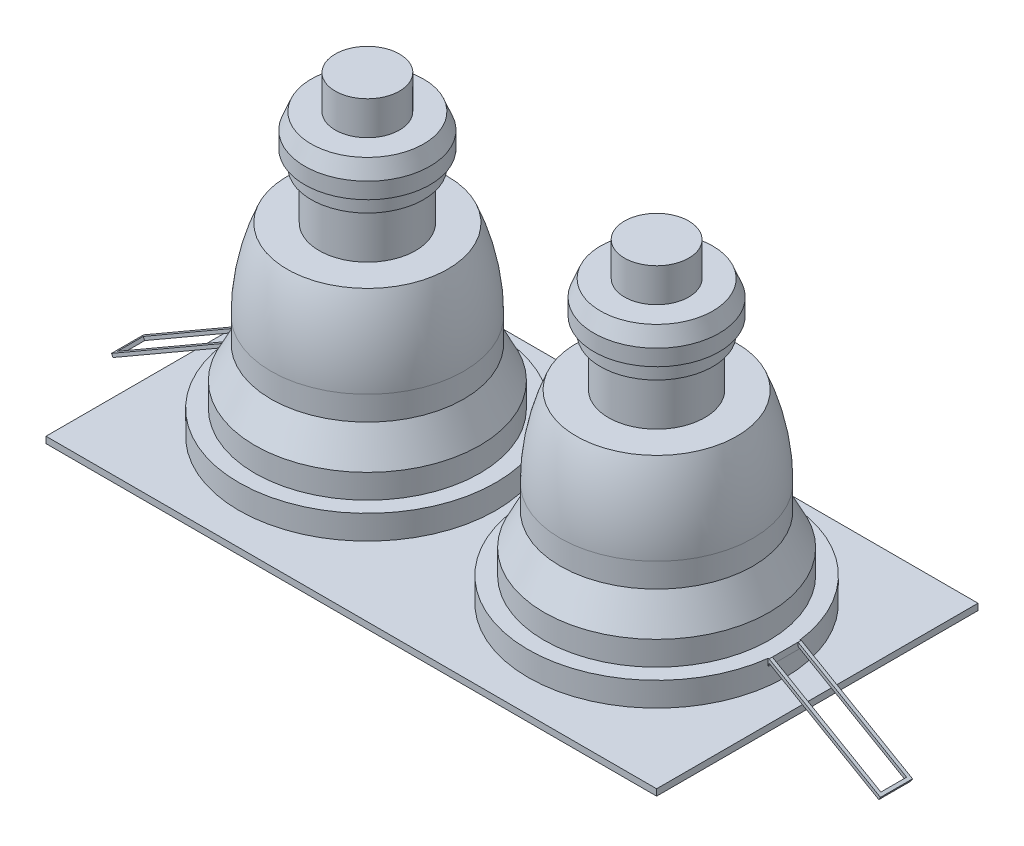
ISO-10303-21;
HEADER;
FILE_DESCRIPTION(('STEP AP214'),'2;1');
FILE_NAME('part.step','',(''),(''),'','','');
FILE_SCHEMA(('AUTOMOTIVE_DESIGN { 1 0 10303 214 1 1 1 1 }'));
ENDSEC;
DATA;
#1=APPLICATION_CONTEXT('core data for automotive mechanical design processes');
#2=APPLICATION_PROTOCOL_DEFINITION('international standard','automotive_design',2000,#1);
#3=PRODUCT_CONTEXT('',#1,'mechanical');
#4=PRODUCT('Part','Part','',(#3));
#5=PRODUCT_RELATED_PRODUCT_CATEGORY('part','',(#4));
#6=PRODUCT_DEFINITION_FORMATION('','',#4);
#7=PRODUCT_DEFINITION_CONTEXT('part definition',#1,'design');
#8=PRODUCT_DEFINITION('design','',#6,#7);
#9=PRODUCT_DEFINITION_SHAPE('','',#8);
#10=(LENGTH_UNIT() NAMED_UNIT(*) SI_UNIT(.MILLI.,.METRE.));
#11=(NAMED_UNIT(*) PLANE_ANGLE_UNIT() SI_UNIT($,.RADIAN.));
#12=(NAMED_UNIT(*) SI_UNIT($,.STERADIAN.) SOLID_ANGLE_UNIT());
#13=UNCERTAINTY_MEASURE_WITH_UNIT(LENGTH_MEASURE(1.E-05),#10,'distance_accuracy_value','');
#14=(GEOMETRIC_REPRESENTATION_CONTEXT(3) GLOBAL_UNCERTAINTY_ASSIGNED_CONTEXT((#13)) GLOBAL_UNIT_ASSIGNED_CONTEXT((#10,
#11,#12)) REPRESENTATION_CONTEXT('',''));
#15=CARTESIAN_POINT('',(0.,0.,0.));
#16=DIRECTION('',(0.,0.,1.));
#17=DIRECTION('',(1.,0.,0.));
#18=AXIS2_PLACEMENT_3D('',#15,#16,#17);
#19=CARTESIAN_POINT('',(0.,0.,0.));
#20=DIRECTION('',(0.,-1.,0.));
#21=DIRECTION('',(0.,0.,-1.));
#22=AXIS2_PLACEMENT_3D('',#19,#20,#21);
#23=PLANE('',#22);
#24=DIRECTION('',(0.,0.,-1.));
#25=VECTOR('',#24,1.);
#26=CARTESIAN_POINT('',(-140.,0.,50.));
#27=LINE('',#26,#25);
#28=CARTESIAN_POINT('',(-140.,0.,50.));
#29=VERTEX_POINT('',#28);
#30=CARTESIAN_POINT('',(-140.,0.,-50.));
#31=VERTEX_POINT('',#30);
#32=EDGE_CURVE('E894',#29,#31,#27,.T.);
#33=ORIENTED_EDGE('',*,*,#32,.T.);
#34=DIRECTION('',(-1.,0.,0.));
#35=VECTOR('',#34,1.);
#36=CARTESIAN_POINT('',(-50.,0.,-50.));
#37=LINE('',#36,#35);
#38=CARTESIAN_POINT('',(50.,0.,-50.));
#39=VERTEX_POINT('',#38);
#40=EDGE_CURVE('E688',#39,#31,#37,.T.);
#41=ORIENTED_EDGE('',*,*,#40,.F.);
#42=DIRECTION('',(0.,0.,-1.));
#43=VECTOR('',#42,1.);
#44=CARTESIAN_POINT('',(50.,0.,50.));
#45=LINE('',#44,#43);
#46=CARTESIAN_POINT('',(50.,0.,50.));
#47=VERTEX_POINT('',#46);
#48=EDGE_CURVE('E697',#47,#39,#45,.T.);
#49=ORIENTED_EDGE('',*,*,#48,.F.);
#50=DIRECTION('',(1.,0.,0.));
#51=VECTOR('',#50,1.);
#52=CARTESIAN_POINT('',(-50.,0.,50.));
#53=LINE('',#52,#51);
#54=EDGE_CURVE('E683',#29,#47,#53,.T.);
#55=ORIENTED_EDGE('',*,*,#54,.F.);
#56=EDGE_LOOP('',(#33,#41,#49,#55));
#57=FACE_BOUND('',#56,.T.);
#58=DIRECTION('',(1.,0.,0.));
#59=VECTOR('',#58,1.);
#60=CARTESIAN_POINT('',(-40.,0.,-40.));
#61=LINE('',#60,#59);
#62=CARTESIAN_POINT('',(-40.,0.,-40.));
#63=VERTEX_POINT('',#62);
#64=CARTESIAN_POINT('',(40.,0.,-40.));
#65=VERTEX_POINT('',#64);
#66=EDGE_CURVE('E935',#63,#65,#61,.T.);
#67=ORIENTED_EDGE('',*,*,#66,.F.);
#68=DIRECTION('',(0.,0.,-1.));
#69=VECTOR('',#68,1.);
#70=CARTESIAN_POINT('',(-40.,0.,40.));
#71=LINE('',#70,#69);
#72=CARTESIAN_POINT('',(-40.,0.,40.));
#73=VERTEX_POINT('',#72);
#74=EDGE_CURVE('E931',#73,#63,#71,.T.);
#75=ORIENTED_EDGE('',*,*,#74,.F.);
#76=DIRECTION('',(-1.,0.,0.));
#77=VECTOR('',#76,1.);
#78=CARTESIAN_POINT('',(40.,0.,40.));
#79=LINE('',#78,#77);
#80=CARTESIAN_POINT('',(40.,0.,40.));
#81=VERTEX_POINT('',#80);
#82=EDGE_CURVE('E910',#81,#73,#79,.T.);
#83=ORIENTED_EDGE('',*,*,#82,.F.);
#84=DIRECTION('',(0.,0.,1.));
#85=VECTOR('',#84,1.);
#86=CARTESIAN_POINT('',(40.,0.,-40.));
#87=LINE('',#86,#85);
#88=EDGE_CURVE('E916',#65,#81,#87,.T.);
#89=ORIENTED_EDGE('',*,*,#88,.F.);
#90=EDGE_LOOP('',(#67,#75,#83,#89));
#91=FACE_BOUND('',#90,.T.);
#92=DIRECTION('',(0.,0.,1.));
#93=VECTOR('',#92,1.);
#94=CARTESIAN_POINT('',(-130.,0.,-40.));
#95=LINE('',#94,#93);
#96=CARTESIAN_POINT('',(-130.,0.,-40.));
#97=VERTEX_POINT('',#96);
#98=CARTESIAN_POINT('',(-130.,0.,40.));
#99=VERTEX_POINT('',#98);
#100=EDGE_CURVE('E314',#97,#99,#95,.T.);
#101=ORIENTED_EDGE('',*,*,#100,.T.);
#102=DIRECTION('',(1.,0.,0.));
#103=VECTOR('',#102,1.);
#104=CARTESIAN_POINT('',(-130.,0.,40.));
#105=LINE('',#104,#103);
#106=CARTESIAN_POINT('',(-50.,0.,40.));
#107=VERTEX_POINT('',#106);
#108=EDGE_CURVE('E64',#99,#107,#105,.T.);
#109=ORIENTED_EDGE('',*,*,#108,.T.);
#110=DIRECTION('',(0.,0.,-1.));
#111=VECTOR('',#110,1.);
#112=CARTESIAN_POINT('',(-50.,0.,40.));
#113=LINE('',#112,#111);
#114=CARTESIAN_POINT('',(-50.,0.,-40.));
#115=VERTEX_POINT('',#114);
#116=EDGE_CURVE('E301',#107,#115,#113,.T.);
#117=ORIENTED_EDGE('',*,*,#116,.T.);
#118=DIRECTION('',(-1.,0.,0.));
#119=VECTOR('',#118,1.);
#120=CARTESIAN_POINT('',(-50.,0.,-40.));
#121=LINE('',#120,#119);
#122=EDGE_CURVE('E305',#115,#97,#121,.T.);
#123=ORIENTED_EDGE('',*,*,#122,.T.);
#124=EDGE_LOOP('',(#101,#109,#117,#123));
#125=FACE_BOUND('',#124,.T.);
#126=ADVANCED_FACE('F47',(#57,#91,#125),#23,.T.);
#127=CARTESIAN_POINT('',(-130.,0.,0.));
#128=DIRECTION('',(-1.,0.,0.));
#129=DIRECTION('',(0.,0.,-1.));
#130=AXIS2_PLACEMENT_3D('',#127,#128,#129);
#131=PLANE('',#130);
#132=DIRECTION('',(0.,0.,-1.));
#133=VECTOR('',#132,1.);
#134=CARTESIAN_POINT('',(-130.,8.34529946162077,0.));
#135=LINE('',#134,#133);
#136=CARTESIAN_POINT('',(-130.,8.34529946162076,5.));
#137=VERTEX_POINT('',#136);
#138=CARTESIAN_POINT('',(-130.,8.34529946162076,4.));
#139=VERTEX_POINT('',#138);
#140=EDGE_CURVE('E784',#137,#139,#135,.T.);
#141=ORIENTED_EDGE('',*,*,#140,.T.);
#142=DIRECTION('',(0.,1.,0.));
#143=VECTOR('',#142,1.);
#144=CARTESIAN_POINT('',(-130.,0.,4.));
#145=LINE('',#144,#143);
#146=CARTESIAN_POINT('',(-130.,9.5,4.));
#147=VERTEX_POINT('',#146);
#148=EDGE_CURVE('E12',#139,#147,#145,.T.);
#149=ORIENTED_EDGE('',*,*,#148,.T.);
#150=DIRECTION('',(0.,0.,1.));
#151=VECTOR('',#150,1.);
#152=CARTESIAN_POINT('',(-130.,9.5,-5.));
#153=LINE('',#152,#151);
#154=CARTESIAN_POINT('',(-130.,9.5,-4.));
#155=VERTEX_POINT('',#154);
#156=EDGE_CURVE('E730',#155,#147,#153,.T.);
#157=ORIENTED_EDGE('',*,*,#156,.F.);
#158=DIRECTION('',(0.,-1.,0.));
#159=VECTOR('',#158,1.);
#160=CARTESIAN_POINT('',(-130.,0.,-4.));
#161=LINE('',#160,#159);
#162=CARTESIAN_POINT('',(-130.,8.34529946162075,-4.));
#163=VERTEX_POINT('',#162);
#164=EDGE_CURVE('E57',#155,#163,#161,.T.);
#165=ORIENTED_EDGE('',*,*,#164,.T.);
#166=CARTESIAN_POINT('',(-130.,8.34529946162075,-5.));
#167=VERTEX_POINT('',#166);
#168=EDGE_CURVE('E727',#163,#167,#135,.T.);
#169=ORIENTED_EDGE('',*,*,#168,.T.);
#170=DIRECTION('',(0.,1.,0.));
#171=VECTOR('',#170,1.);
#172=CARTESIAN_POINT('',(-130.,7.5,-5.));
#173=LINE('',#172,#171);
#174=CARTESIAN_POINT('',(-130.,7.5,-5.));
#175=VERTEX_POINT('',#174);
#176=EDGE_CURVE('E808',#175,#167,#173,.T.);
#177=ORIENTED_EDGE('',*,*,#176,.F.);
#178=DIRECTION('',(0.,0.,-1.));
#179=VECTOR('',#178,1.);
#180=CARTESIAN_POINT('',(-130.,7.5,5.));
#181=LINE('',#180,#179);
#182=CARTESIAN_POINT('',(-130.,7.5,0.));
#183=VERTEX_POINT('',#182);
#184=EDGE_CURVE('E811',#183,#175,#181,.T.);
#185=ORIENTED_EDGE('',*,*,#184,.F.);
#186=DIRECTION('',(0.,0.,-1.));
#187=VECTOR('',#186,1.);
#188=CARTESIAN_POINT('',(-130.,7.5,5.));
#189=LINE('',#188,#187);
#190=CARTESIAN_POINT('',(-130.,7.5,5.));
#191=VERTEX_POINT('',#190);
#192=EDGE_CURVE('E788',#191,#183,#189,.T.);
#193=ORIENTED_EDGE('',*,*,#192,.F.);
#194=DIRECTION('',(0.,-1.,0.));
#195=VECTOR('',#194,1.);
#196=CARTESIAN_POINT('',(-130.,9.5,5.));
#197=LINE('',#196,#195);
#198=EDGE_CURVE('E785',#137,#191,#197,.T.);
#199=ORIENTED_EDGE('',*,*,#198,.F.);
#200=EDGE_LOOP('',(#141,#149,#157,#165,#169,#177,#185,#193,#199));
#201=FACE_BOUND('',#200,.T.);
#202=ADVANCED_FACE('F384',(#201),#131,.T.);
#203=CARTESIAN_POINT('',(-90.,0.,0.));
#204=DIRECTION('',(0.,-1.,0.));
#205=DIRECTION('',(0.,0.,-1.));
#206=AXIS2_PLACEMENT_3D('',#203,#204,#205);
#207=CYLINDRICAL_SURFACE('',#206,40.);
#208=CARTESIAN_POINT('',(-90.,2.,0.));
#209=DIRECTION('',(0.,1.,0.));
#210=DIRECTION('',(0.,0.,-1.));
#211=AXIS2_PLACEMENT_3D('',#208,#209,#210);
#212=CIRCLE('',#211,40.);
#213=CARTESIAN_POINT('',(-90.,2.,-40.));
#214=VERTEX_POINT('',#213);
#215=EDGE_CURVE('E867',#214,#214,#212,.T.);
#216=ORIENTED_EDGE('',*,*,#215,.T.);
#217=EDGE_LOOP('',(#216));
#218=FACE_BOUND('',#217,.T.);
#219=CARTESIAN_POINT('',(-90.,9.5,0.));
#220=DIRECTION('',(0.,1.,0.));
#221=DIRECTION('',(0.,0.,-1.));
#222=AXIS2_PLACEMENT_3D('',#219,#220,#221);
#223=CIRCLE('',#222,40.);
#224=CARTESIAN_POINT('',(-129.686269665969,9.5,5.));
#225=VERTEX_POINT('',#224);
#226=CARTESIAN_POINT('',(-129.686269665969,9.5,-5.));
#227=VERTEX_POINT('',#226);
#228=EDGE_CURVE('E871',#225,#227,#223,.T.);
#229=ORIENTED_EDGE('',*,*,#228,.F.);
#230=DIRECTION('',(0.,-1.,0.));
#231=VECTOR('',#230,1.);
#232=CARTESIAN_POINT('',(-129.686269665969,0.,5.));
#233=LINE('',#232,#231);
#234=CARTESIAN_POINT('',(-129.686269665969,7.5,5.));
#235=VERTEX_POINT('',#234);
#236=EDGE_CURVE('E790',#235,#225,#233,.F.);
#237=ORIENTED_EDGE('',*,*,#236,.F.);
#238=CARTESIAN_POINT('',(-90.,7.5,0.));
#239=DIRECTION('',(0.,1.,0.));
#240=DIRECTION('',(0.,0.,1.));
#241=AXIS2_PLACEMENT_3D('',#238,#239,#240);
#242=CIRCLE('',#241,40.);
#243=EDGE_CURVE('E796',#183,#235,#242,.T.);
#244=ORIENTED_EDGE('',*,*,#243,.F.);
#245=CARTESIAN_POINT('',(-90.,7.5,0.));
#246=DIRECTION('',(0.,1.,0.));
#247=DIRECTION('',(0.,0.,1.));
#248=AXIS2_PLACEMENT_3D('',#245,#246,#247);
#249=CIRCLE('',#248,40.);
#250=CARTESIAN_POINT('',(-129.686269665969,7.5,-5.));
#251=VERTEX_POINT('',#250);
#252=EDGE_CURVE('E817',#251,#183,#249,.T.);
#253=ORIENTED_EDGE('',*,*,#252,.F.);
#254=DIRECTION('',(0.,-1.,0.));
#255=VECTOR('',#254,1.);
#256=CARTESIAN_POINT('',(-129.686269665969,0.,-5.));
#257=LINE('',#256,#255);
#258=EDGE_CURVE('E801',#227,#251,#257,.T.);
#259=ORIENTED_EDGE('',*,*,#258,.F.);
#260=EDGE_LOOP('',(#229,#237,#244,#253,#259));
#261=FACE_BOUND('',#260,.T.);
#262=ADVANCED_FACE('F387',(#218,#261),#207,.T.);
#263=CARTESIAN_POINT('',(-50.,2.,50.));
#264=DIRECTION('',(0.,0.,-1.));
#265=DIRECTION('',(-1.,0.,0.));
#266=AXIS2_PLACEMENT_3D('',#263,#264,#265);
#267=PLANE('',#266);
#268=DIRECTION('',(0.,-1.,0.));
#269=VECTOR('',#268,1.);
#270=CARTESIAN_POINT('',(50.,2.,50.));
#271=LINE('',#270,#269);
#272=CARTESIAN_POINT('',(50.,2.,50.));
#273=VERTEX_POINT('',#272);
#274=EDGE_CURVE('E705',#273,#47,#271,.T.);
#275=ORIENTED_EDGE('',*,*,#274,.F.);
#276=DIRECTION('',(1.,0.,0.));
#277=VECTOR('',#276,1.);
#278=CARTESIAN_POINT('',(-50.,2.,50.));
#279=LINE('',#278,#277);
#280=CARTESIAN_POINT('',(-140.,2.,50.));
#281=VERTEX_POINT('',#280);
#282=EDGE_CURVE('E684',#281,#273,#279,.T.);
#283=ORIENTED_EDGE('',*,*,#282,.F.);
#284=DIRECTION('',(0.,-1.,0.));
#285=VECTOR('',#284,1.);
#286=CARTESIAN_POINT('',(-140.,2.,50.));
#287=LINE('',#286,#285);
#288=EDGE_CURVE('E899',#281,#29,#287,.T.);
#289=ORIENTED_EDGE('',*,*,#288,.T.);
#290=ORIENTED_EDGE('',*,*,#54,.T.);
#291=EDGE_LOOP('',(#275,#283,#289,#290));
#292=FACE_BOUND('',#291,.T.);
#293=ADVANCED_FACE('F49',(#292),#267,.F.);
#294=CARTESIAN_POINT('',(50.,2.,50.));
#295=DIRECTION('',(-1.,0.,0.));
#296=DIRECTION('',(0.,0.,1.));
#297=AXIS2_PLACEMENT_3D('',#294,#295,#296);
#298=PLANE('',#297);
#299=ORIENTED_EDGE('',*,*,#48,.T.);
#300=DIRECTION('',(0.,-1.,0.));
#301=VECTOR('',#300,1.);
#302=CARTESIAN_POINT('',(50.,2.,-50.));
#303=LINE('',#302,#301);
#304=CARTESIAN_POINT('',(50.,2.,-50.));
#305=VERTEX_POINT('',#304);
#306=EDGE_CURVE('E694',#305,#39,#303,.T.);
#307=ORIENTED_EDGE('',*,*,#306,.F.);
#308=DIRECTION('',(0.,0.,-1.));
#309=VECTOR('',#308,1.);
#310=CARTESIAN_POINT('',(50.,2.,50.));
#311=LINE('',#310,#309);
#312=EDGE_CURVE('E687',#273,#305,#311,.T.);
#313=ORIENTED_EDGE('',*,*,#312,.F.);
#314=ORIENTED_EDGE('',*,*,#274,.T.);
#315=EDGE_LOOP('',(#299,#307,#313,#314));
#316=FACE_BOUND('',#315,.T.);
#317=ADVANCED_FACE('F980',(#316),#298,.F.);
#318=CARTESIAN_POINT('',(-50.,2.,-50.));
#319=DIRECTION('',(0.,0.,1.));
#320=DIRECTION('',(1.,0.,0.));
#321=AXIS2_PLACEMENT_3D('',#318,#319,#320);
#322=PLANE('',#321);
#323=ORIENTED_EDGE('',*,*,#40,.T.);
#324=DIRECTION('',(0.,-1.,0.));
#325=VECTOR('',#324,1.);
#326=CARTESIAN_POINT('',(-140.,2.,-50.));
#327=LINE('',#326,#325);
#328=CARTESIAN_POINT('',(-140.,2.,-50.));
#329=VERTEX_POINT('',#328);
#330=EDGE_CURVE('E906',#329,#31,#327,.T.);
#331=ORIENTED_EDGE('',*,*,#330,.F.);
#332=DIRECTION('',(-1.,0.,0.));
#333=VECTOR('',#332,1.);
#334=CARTESIAN_POINT('',(-50.,2.,-50.));
#335=LINE('',#334,#333);
#336=EDGE_CURVE('E691',#305,#329,#335,.T.);
#337=ORIENTED_EDGE('',*,*,#336,.F.);
#338=ORIENTED_EDGE('',*,*,#306,.T.);
#339=EDGE_LOOP('',(#323,#331,#337,#338));
#340=FACE_BOUND('',#339,.T.);
#341=ADVANCED_FACE('F978',(#340),#322,.F.);
#342=CARTESIAN_POINT('',(0.,2.,0.));
#343=DIRECTION('',(0.,-1.,0.));
#344=DIRECTION('',(0.,0.,-1.));
#345=AXIS2_PLACEMENT_3D('',#342,#343,#344);
#346=PLANE('',#345);
#347=ORIENTED_EDGE('',*,*,#215,.F.);
#348=EDGE_LOOP('',(#347));
#349=FACE_BOUND('',#348,.T.);
#350=CARTESIAN_POINT('',(0.,2.,0.));
#351=DIRECTION('',(0.,-1.,0.));
#352=DIRECTION('',(0.,0.,-1.));
#353=AXIS2_PLACEMENT_3D('',#350,#351,#352);
#354=CIRCLE('',#353,40.);
#355=CARTESIAN_POINT('',(0.,2.,-40.));
#356=VERTEX_POINT('',#355);
#357=EDGE_CURVE('E656',#356,#356,#354,.T.);
#358=ORIENTED_EDGE('',*,*,#357,.T.);
#359=EDGE_LOOP('',(#358));
#360=FACE_BOUND('',#359,.T.);
#361=ORIENTED_EDGE('',*,*,#336,.T.);
#362=DIRECTION('',(0.,0.,-1.));
#363=VECTOR('',#362,1.);
#364=CARTESIAN_POINT('',(-140.,2.,50.));
#365=LINE('',#364,#363);
#366=EDGE_CURVE('E895',#281,#329,#365,.T.);
#367=ORIENTED_EDGE('',*,*,#366,.F.);
#368=ORIENTED_EDGE('',*,*,#282,.T.);
#369=ORIENTED_EDGE('',*,*,#312,.T.);
#370=EDGE_LOOP('',(#361,#367,#368,#369));
#371=FACE_BOUND('',#370,.T.);
#372=ADVANCED_FACE('F976',(#349,#360,#371),#346,.F.);
#373=CARTESIAN_POINT('',(0.,59.5,0.));
#374=DIRECTION('',(0.,-1.,0.));
#375=DIRECTION('',(0.,0.,-1.));
#376=AXIS2_PLACEMENT_3D('',#373,#374,#375);
#377=PLANE('',#376);
#378=CARTESIAN_POINT('',(0.,59.5,0.));
#379=DIRECTION('',(0.,-1.,0.));
#380=DIRECTION('',(0.,0.,-1.));
#381=AXIS2_PLACEMENT_3D('',#378,#379,#380);
#382=CIRCLE('',#381,25.);
#383=CARTESIAN_POINT('',(0.,59.5,-25.));
#384=VERTEX_POINT('',#383);
#385=EDGE_CURVE('E679',#384,#384,#382,.T.);
#386=ORIENTED_EDGE('',*,*,#385,.F.);
#387=EDGE_LOOP('',(#386));
#388=FACE_BOUND('',#387,.T.);
#389=CARTESIAN_POINT('',(0.,59.5,0.));
#390=DIRECTION('',(0.,-1.,0.));
#391=DIRECTION('',(0.,0.,-1.));
#392=AXIS2_PLACEMENT_3D('',#389,#390,#391);
#393=CIRCLE('',#392,15.);
#394=CARTESIAN_POINT('',(0.,59.5,-15.));
#395=VERTEX_POINT('',#394);
#396=EDGE_CURVE('E620',#395,#395,#393,.T.);
#397=ORIENTED_EDGE('',*,*,#396,.T.);
#398=EDGE_LOOP('',(#397));
#399=FACE_BOUND('',#398,.T.);
#400=ADVANCED_FACE('F1000',(#388,#399),#377,.F.);
#401=CARTESIAN_POINT('',(0.,34.5,0.));
#402=DIRECTION('',(0.,-1.,0.));
#403=DIRECTION('',(0.,0.,-1.));
#404=AXIS2_PLACEMENT_3D('',#401,#402,#403);
#405=DEGENERATE_TOROIDAL_SURFACE('',#404,35.0000000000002,65.0000000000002,.F.);
#406=CARTESIAN_POINT('',(0.,34.5,0.));
#407=DIRECTION('',(0.,-1.,0.));
#408=DIRECTION('',(0.,0.,-1.));
#409=AXIS2_PLACEMENT_3D('',#406,#407,#408);
#410=CIRCLE('',#409,30.);
#411=CARTESIAN_POINT('',(0.,34.5,-30.));
#412=VERTEX_POINT('',#411);
#413=EDGE_CURVE('E675',#412,#412,#410,.T.);
#414=ORIENTED_EDGE('',*,*,#413,.F.);
#415=EDGE_LOOP('',(#414));
#416=FACE_BOUND('',#415,.T.);
#417=ORIENTED_EDGE('',*,*,#385,.T.);
#418=EDGE_LOOP('',(#417));
#419=FACE_BOUND('',#418,.T.);
#420=ADVANCED_FACE('F1005',(#416,#419),#405,.F.);
#421=CARTESIAN_POINT('',(0.,0.,0.));
#422=DIRECTION('',(0.,-1.,0.));
#423=DIRECTION('',(0.,0.,-1.));
#424=AXIS2_PLACEMENT_3D('',#421,#422,#423);
#425=CYLINDRICAL_SURFACE('',#424,30.);
#426=ORIENTED_EDGE('',*,*,#413,.T.);
#427=EDGE_LOOP('',(#426));
#428=FACE_BOUND('',#427,.T.);
#429=CARTESIAN_POINT('',(0.,27.,0.));
#430=DIRECTION('',(0.,-1.,0.));
#431=DIRECTION('',(0.,0.,-1.));
#432=AXIS2_PLACEMENT_3D('',#429,#430,#431);
#433=CIRCLE('',#432,30.);
#434=CARTESIAN_POINT('',(0.,27.,-30.));
#435=VERTEX_POINT('',#434);
#436=EDGE_CURVE('E671',#435,#435,#433,.T.);
#437=ORIENTED_EDGE('',*,*,#436,.F.);
#438=EDGE_LOOP('',(#437));
#439=FACE_BOUND('',#438,.T.);
#440=ADVANCED_FACE('F1035',(#428,#439),#425,.T.);
#441=CARTESIAN_POINT('',(0.,27.,0.));
#442=DIRECTION('',(0.,-1.,0.));
#443=DIRECTION('',(0.,0.,-1.));
#444=AXIS2_PLACEMENT_3D('',#441,#442,#443);
#445=CONICAL_SURFACE('',#444,30.,0.463647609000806);
#446=CARTESIAN_POINT('',(0.,17.,0.));
#447=DIRECTION('',(0.,-1.,0.));
#448=DIRECTION('',(0.,0.,-1.));
#449=AXIS2_PLACEMENT_3D('',#446,#447,#448);
#450=CIRCLE('',#449,35.);
#451=CARTESIAN_POINT('',(0.,17.,-35.));
#452=VERTEX_POINT('',#451);
#453=EDGE_CURVE('E667',#452,#452,#450,.T.);
#454=ORIENTED_EDGE('',*,*,#453,.F.);
#455=EDGE_LOOP('',(#454));
#456=FACE_BOUND('',#455,.T.);
#457=ORIENTED_EDGE('',*,*,#436,.T.);
#458=EDGE_LOOP('',(#457));
#459=FACE_BOUND('',#458,.T.);
#460=ADVANCED_FACE('F1031',(#456,#459),#445,.T.);
#461=CARTESIAN_POINT('',(0.,0.,0.));
#462=DIRECTION('',(0.,-1.,0.));
#463=DIRECTION('',(0.,0.,-1.));
#464=AXIS2_PLACEMENT_3D('',#461,#462,#463);
#465=CYLINDRICAL_SURFACE('',#464,35.);
#466=ORIENTED_EDGE('',*,*,#453,.T.);
#467=EDGE_LOOP('',(#466));
#468=FACE_BOUND('',#467,.T.);
#469=CARTESIAN_POINT('',(0.,9.5,0.));
#470=DIRECTION('',(0.,-1.,0.));
#471=DIRECTION('',(0.,0.,-1.));
#472=AXIS2_PLACEMENT_3D('',#469,#470,#471);
#473=CIRCLE('',#472,35.);
#474=CARTESIAN_POINT('',(0.,9.5,-35.));
#475=VERTEX_POINT('',#474);
#476=EDGE_CURVE('E663',#475,#475,#473,.T.);
#477=ORIENTED_EDGE('',*,*,#476,.F.);
#478=EDGE_LOOP('',(#477));
#479=FACE_BOUND('',#478,.T.);
#480=ADVANCED_FACE('F1024',(#468,#479),#465,.T.);
#481=CARTESIAN_POINT('',(0.,9.5,0.));
#482=DIRECTION('',(0.,1.,0.));
#483=DIRECTION('',(0.,0.,1.));
#484=AXIS2_PLACEMENT_3D('',#481,#482,#483);
#485=PLANE('',#484);
#486=ORIENTED_EDGE('',*,*,#476,.T.);
#487=EDGE_LOOP('',(#486));
#488=FACE_BOUND('',#487,.T.);
#489=CARTESIAN_POINT('',(0.,9.5,0.));
#490=DIRECTION('',(0.,-1.,0.));
#491=DIRECTION('',(0.,0.,-1.));
#492=AXIS2_PLACEMENT_3D('',#489,#490,#491);
#493=CIRCLE('',#492,40.);
#494=CARTESIAN_POINT('',(39.6862696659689,9.5,5.));
#495=VERTEX_POINT('',#494);
#496=CARTESIAN_POINT('',(39.6862696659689,9.5,-5.));
#497=VERTEX_POINT('',#496);
#498=EDGE_CURVE('E660',#495,#497,#493,.T.);
#499=ORIENTED_EDGE('',*,*,#498,.F.);
#500=DIRECTION('',(1.,0.,0.));
#501=VECTOR('',#500,1.);
#502=CARTESIAN_POINT('',(-50.002,9.5,5.));
#503=LINE('',#502,#501);
#504=CARTESIAN_POINT('',(40.,9.5,5.));
#505=VERTEX_POINT('',#504);
#506=EDGE_CURVE('E579',#495,#505,#503,.T.);
#507=ORIENTED_EDGE('',*,*,#506,.T.);
#508=DIRECTION('',(0.,0.,1.));
#509=VECTOR('',#508,1.);
#510=CARTESIAN_POINT('',(40.,9.5,4.));
#511=LINE('',#510,#509);
#512=CARTESIAN_POINT('',(40.,9.5,4.));
#513=VERTEX_POINT('',#512);
#514=EDGE_CURVE('E545',#513,#505,#511,.T.);
#515=ORIENTED_EDGE('',*,*,#514,.F.);
#516=DIRECTION('',(0.,0.,1.));
#517=VECTOR('',#516,1.);
#518=CARTESIAN_POINT('',(40.,9.5,-5.));
#519=LINE('',#518,#517);
#520=CARTESIAN_POINT('',(40.,9.5,-4.));
#521=VERTEX_POINT('',#520);
#522=EDGE_CURVE('E601',#521,#513,#519,.T.);
#523=ORIENTED_EDGE('',*,*,#522,.F.);
#524=CARTESIAN_POINT('',(40.,9.5,-5.));
#525=VERTEX_POINT('',#524);
#526=EDGE_CURVE('E596',#525,#521,#519,.T.);
#527=ORIENTED_EDGE('',*,*,#526,.F.);
#528=DIRECTION('',(1.,0.,0.));
#529=VECTOR('',#528,1.);
#530=CARTESIAN_POINT('',(-50.002,9.5,-5.));
#531=LINE('',#530,#529);
#532=EDGE_CURVE('E600',#497,#525,#531,.T.);
#533=ORIENTED_EDGE('',*,*,#532,.F.);
#534=EDGE_LOOP('',(#499,#507,#515,#523,#527,#533));
#535=FACE_BOUND('',#534,.T.);
#536=ADVANCED_FACE('F1014',(#488,#535),#485,.T.);
#537=CARTESIAN_POINT('',(0.,0.,0.));
#538=DIRECTION('',(0.,-1.,0.));
#539=DIRECTION('',(0.,0.,-1.));
#540=AXIS2_PLACEMENT_3D('',#537,#538,#539);
#541=CYLINDRICAL_SURFACE('',#540,40.);
#542=CARTESIAN_POINT('',(0.,7.5,0.));
#543=DIRECTION('',(0.,-1.,0.));
#544=DIRECTION('',(0.,0.,-1.));
#545=AXIS2_PLACEMENT_3D('',#542,#543,#544);
#546=CIRCLE('',#545,40.);
#547=CARTESIAN_POINT('',(40.,7.5,0.));
#548=VERTEX_POINT('',#547);
#549=CARTESIAN_POINT('',(39.6862696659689,7.5,5.));
#550=VERTEX_POINT('',#549);
#551=EDGE_CURVE('E589',#548,#550,#546,.T.);
#552=ORIENTED_EDGE('',*,*,#551,.T.);
#553=DIRECTION('',(0.,-1.,0.));
#554=VECTOR('',#553,1.);
#555=CARTESIAN_POINT('',(39.6862696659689,0.,5.));
#556=LINE('',#555,#554);
#557=EDGE_CURVE('E590',#550,#495,#556,.F.);
#558=ORIENTED_EDGE('',*,*,#557,.T.);
#559=ORIENTED_EDGE('',*,*,#498,.T.);
#560=DIRECTION('',(0.,-1.,0.));
#561=VECTOR('',#560,1.);
#562=CARTESIAN_POINT('',(39.6862696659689,0.,-5.));
#563=LINE('',#562,#561);
#564=CARTESIAN_POINT('',(39.6862696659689,7.5,-5.));
#565=VERTEX_POINT('',#564);
#566=EDGE_CURVE('E617',#497,#565,#563,.T.);
#567=ORIENTED_EDGE('',*,*,#566,.T.);
#568=CARTESIAN_POINT('',(0.,7.5,0.));
#569=DIRECTION('',(0.,-1.,0.));
#570=DIRECTION('',(0.,0.,-1.));
#571=AXIS2_PLACEMENT_3D('',#568,#569,#570);
#572=CIRCLE('',#571,40.);
#573=EDGE_CURVE('E611',#565,#548,#572,.T.);
#574=ORIENTED_EDGE('',*,*,#573,.T.);
#575=EDGE_LOOP('',(#552,#558,#559,#567,#574));
#576=FACE_BOUND('',#575,.T.);
#577=ORIENTED_EDGE('',*,*,#357,.F.);
#578=EDGE_LOOP('',(#577));
#579=FACE_BOUND('',#578,.T.);
#580=ADVANCED_FACE('F1011',(#576,#579),#541,.T.);
#581=CARTESIAN_POINT('',(0.,100.,0.));
#582=DIRECTION('',(0.,1.,0.));
#583=DIRECTION('',(0.,0.,1.));
#584=AXIS2_PLACEMENT_3D('',#581,#582,#583);
#585=PLANE('',#584);
#586=CARTESIAN_POINT('',(0.,100.,0.));
#587=DIRECTION('',(0.,-1.,0.));
#588=DIRECTION('',(0.,0.,-1.));
#589=AXIS2_PLACEMENT_3D('',#586,#587,#588);
#590=CIRCLE('',#589,10.);
#591=CARTESIAN_POINT('',(0.,100.,-10.));
#592=VERTEX_POINT('',#591);
#593=EDGE_CURVE('E652',#592,#592,#590,.T.);
#594=ORIENTED_EDGE('',*,*,#593,.F.);
#595=EDGE_LOOP('',(#594));
#596=FACE_BOUND('',#595,.T.);
#597=ADVANCED_FACE('F1013',(#596),#585,.T.);
#598=CARTESIAN_POINT('',(0.,0.,0.));
#599=DIRECTION('',(0.,-1.,0.));
#600=DIRECTION('',(0.,0.,-1.));
#601=AXIS2_PLACEMENT_3D('',#598,#599,#600);
#602=CYLINDRICAL_SURFACE('',#601,10.);
#603=ORIENTED_EDGE('',*,*,#593,.T.);
#604=EDGE_LOOP('',(#603));
#605=FACE_BOUND('',#604,.T.);
#606=CARTESIAN_POINT('',(0.,89.5,0.));
#607=DIRECTION('',(0.,-1.,0.));
#608=DIRECTION('',(0.,0.,-1.));
#609=AXIS2_PLACEMENT_3D('',#606,#607,#608);
#610=CIRCLE('',#609,10.);
#611=CARTESIAN_POINT('',(0.,89.5,-10.));
#612=VERTEX_POINT('',#611);
#613=EDGE_CURVE('E648',#612,#612,#610,.T.);
#614=ORIENTED_EDGE('',*,*,#613,.F.);
#615=EDGE_LOOP('',(#614));
#616=FACE_BOUND('',#615,.T.);
#617=ADVANCED_FACE('F1021',(#605,#616),#602,.T.);
#618=CARTESIAN_POINT('',(0.,89.5,0.));
#619=DIRECTION('',(0.,-1.,0.));
#620=DIRECTION('',(0.,0.,-1.));
#621=AXIS2_PLACEMENT_3D('',#618,#619,#620);
#622=PLANE('',#621);
#623=CARTESIAN_POINT('',(0.,89.5,0.));
#624=DIRECTION('',(0.,-1.,0.));
#625=DIRECTION('',(0.,0.,-1.));
#626=AXIS2_PLACEMENT_3D('',#623,#624,#625);
#627=CIRCLE('',#626,17.5);
#628=CARTESIAN_POINT('',(0.,89.5,-17.5));
#629=VERTEX_POINT('',#628);
#630=EDGE_CURVE('E644',#629,#629,#627,.T.);
#631=ORIENTED_EDGE('',*,*,#630,.F.);
#632=EDGE_LOOP('',(#631));
#633=FACE_BOUND('',#632,.T.);
#634=ORIENTED_EDGE('',*,*,#613,.T.);
#635=EDGE_LOOP('',(#634));
#636=FACE_BOUND('',#635,.T.);
#637=ADVANCED_FACE('F1414',(#633,#636),#622,.F.);
#638=CARTESIAN_POINT('',(0.,89.5,0.));
#639=DIRECTION('',(0.,-1.,0.));
#640=DIRECTION('',(0.,0.,-1.));
#641=AXIS2_PLACEMENT_3D('',#638,#639,#640);
#642=CONICAL_SURFACE('',#641,17.5,0.380506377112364);
#643=CARTESIAN_POINT('',(0.,84.5,0.));
#644=DIRECTION('',(0.,-1.,0.));
#645=DIRECTION('',(0.,0.,-1.));
#646=AXIS2_PLACEMENT_3D('',#643,#644,#645);
#647=CIRCLE('',#646,19.5);
#648=CARTESIAN_POINT('',(0.,84.5,-19.5));
#649=VERTEX_POINT('',#648);
#650=EDGE_CURVE('E640',#649,#649,#647,.T.);
#651=ORIENTED_EDGE('',*,*,#650,.F.);
#652=EDGE_LOOP('',(#651));
#653=FACE_BOUND('',#652,.T.);
#654=ORIENTED_EDGE('',*,*,#630,.T.);
#655=EDGE_LOOP('',(#654));
#656=FACE_BOUND('',#655,.T.);
#657=ADVANCED_FACE('F1404',(#653,#656),#642,.T.);
#658=CARTESIAN_POINT('',(0.,0.,0.));
#659=DIRECTION('',(0.,-1.,0.));
#660=DIRECTION('',(0.,0.,-1.));
#661=AXIS2_PLACEMENT_3D('',#658,#659,#660);
#662=CYLINDRICAL_SURFACE('',#661,19.5);
#663=ORIENTED_EDGE('',*,*,#650,.T.);
#664=EDGE_LOOP('',(#663));
#665=FACE_BOUND('',#664,.T.);
#666=CARTESIAN_POINT('',(0.,79.5,0.));
#667=DIRECTION('',(0.,-1.,0.));
#668=DIRECTION('',(0.,0.,-1.));
#669=AXIS2_PLACEMENT_3D('',#666,#667,#668);
#670=CIRCLE('',#669,19.5);
#671=CARTESIAN_POINT('',(0.,79.5,-19.5));
#672=VERTEX_POINT('',#671);
#673=EDGE_CURVE('E636',#672,#672,#670,.T.);
#674=ORIENTED_EDGE('',*,*,#673,.F.);
#675=EDGE_LOOP('',(#674));
#676=FACE_BOUND('',#675,.T.);
#677=ADVANCED_FACE('F1394',(#665,#676),#662,.T.);
#678=CARTESIAN_POINT('',(0.,79.5,0.));
#679=DIRECTION('',(0.,-1.,0.));
#680=DIRECTION('',(0.,0.,-1.));
#681=AXIS2_PLACEMENT_3D('',#678,#679,#680);
#682=PLANE('',#681);
#683=ORIENTED_EDGE('',*,*,#673,.T.);
#684=EDGE_LOOP('',(#683));
#685=FACE_BOUND('',#684,.T.);
#686=CARTESIAN_POINT('',(0.,79.5,0.));
#687=DIRECTION('',(0.,-1.,0.));
#688=DIRECTION('',(0.,0.,-1.));
#689=AXIS2_PLACEMENT_3D('',#686,#687,#688);
#690=CIRCLE('',#689,17.5);
#691=CARTESIAN_POINT('',(0.,79.5,-17.5));
#692=VERTEX_POINT('',#691);
#693=EDGE_CURVE('E632',#692,#692,#690,.T.);
#694=ORIENTED_EDGE('',*,*,#693,.F.);
#695=EDGE_LOOP('',(#694));
#696=FACE_BOUND('',#695,.T.);
#697=ADVANCED_FACE('F1384',(#685,#696),#682,.T.);
#698=CARTESIAN_POINT('',(0.,0.,0.));
#699=DIRECTION('',(0.,-1.,0.));
#700=DIRECTION('',(0.,0.,-1.));
#701=AXIS2_PLACEMENT_3D('',#698,#699,#700);
#702=CYLINDRICAL_SURFACE('',#701,17.5);
#703=ORIENTED_EDGE('',*,*,#693,.T.);
#704=EDGE_LOOP('',(#703));
#705=FACE_BOUND('',#704,.T.);
#706=CARTESIAN_POINT('',(0.,74.5,0.));
#707=DIRECTION('',(0.,-1.,0.));
#708=DIRECTION('',(0.,0.,-1.));
#709=AXIS2_PLACEMENT_3D('',#706,#707,#708);
#710=CIRCLE('',#709,17.5);
#711=CARTESIAN_POINT('',(0.,74.5,-17.5));
#712=VERTEX_POINT('',#711);
#713=EDGE_CURVE('E628',#712,#712,#710,.T.);
#714=ORIENTED_EDGE('',*,*,#713,.F.);
#715=EDGE_LOOP('',(#714));
#716=FACE_BOUND('',#715,.T.);
#717=ADVANCED_FACE('F1065',(#705,#716),#702,.T.);
#718=CARTESIAN_POINT('',(0.,74.5,0.));
#719=DIRECTION('',(0.,-1.,0.));
#720=DIRECTION('',(0.,0.,-1.));
#721=AXIS2_PLACEMENT_3D('',#718,#719,#720);
#722=PLANE('',#721);
#723=ORIENTED_EDGE('',*,*,#713,.T.);
#724=EDGE_LOOP('',(#723));
#725=FACE_BOUND('',#724,.T.);
#726=CARTESIAN_POINT('',(0.,74.5,0.));
#727=DIRECTION('',(0.,-1.,0.));
#728=DIRECTION('',(0.,0.,-1.));
#729=AXIS2_PLACEMENT_3D('',#726,#727,#728);
#730=CIRCLE('',#729,15.);
#731=CARTESIAN_POINT('',(0.,74.5,-15.));
#732=VERTEX_POINT('',#731);
#733=EDGE_CURVE('E624',#732,#732,#730,.T.);
#734=ORIENTED_EDGE('',*,*,#733,.F.);
#735=EDGE_LOOP('',(#734));
#736=FACE_BOUND('',#735,.T.);
#737=ADVANCED_FACE('F1053',(#725,#736),#722,.T.);
#738=CARTESIAN_POINT('',(0.,0.,0.));
#739=DIRECTION('',(0.,-1.,0.));
#740=DIRECTION('',(0.,0.,-1.));
#741=AXIS2_PLACEMENT_3D('',#738,#739,#740);
#742=CYLINDRICAL_SURFACE('',#741,15.);
#743=ORIENTED_EDGE('',*,*,#733,.T.);
#744=EDGE_LOOP('',(#743));
#745=FACE_BOUND('',#744,.T.);
#746=ORIENTED_EDGE('',*,*,#396,.F.);
#747=EDGE_LOOP('',(#746));
#748=FACE_BOUND('',#747,.T.);
#749=ADVANCED_FACE('F1050',(#745,#748),#742,.T.);
#750=CARTESIAN_POINT('',(-50.002,7.5,-5.));
#751=DIRECTION('',(0.,0.,-1.));
#752=DIRECTION('',(-1.,0.,0.));
#753=AXIS2_PLACEMENT_3D('',#750,#751,#752);
#754=PLANE('',#753);
#755=ORIENTED_EDGE('',*,*,#532,.T.);
#756=DIRECTION('',(-0.86602540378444,0.499999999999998,0.));
#757=VECTOR('',#756,1.);
#758=CARTESIAN_POINT('',(40.,9.5,-5.));
#759=LINE('',#758,#757);
#760=CARTESIAN_POINT('',(74.6410161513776,-10.4999999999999,-5.));
#761=VERTEX_POINT('',#760);
#762=EDGE_CURVE('E514',#761,#525,#759,.T.);
#763=ORIENTED_EDGE('',*,*,#762,.F.);
#764=DIRECTION('',(0.499999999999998,0.86602540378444,0.));
#765=VECTOR('',#764,1.);
#766=CARTESIAN_POINT('',(74.1410161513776,-11.3660254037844,-5.));
#767=LINE('',#766,#765);
#768=CARTESIAN_POINT('',(74.1410161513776,-11.3660254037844,-5.));
#769=VERTEX_POINT('',#768);
#770=EDGE_CURVE('E560',#769,#761,#767,.T.);
#771=ORIENTED_EDGE('',*,*,#770,.F.);
#772=DIRECTION('',(-0.86602540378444,0.499999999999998,0.));
#773=VECTOR('',#772,1.);
#774=CARTESIAN_POINT('',(39.5,8.63397459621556,-5.));
#775=LINE('',#774,#773);
#776=CARTESIAN_POINT('',(40.,8.34529946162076,-5.));
#777=VERTEX_POINT('',#776);
#778=EDGE_CURVE('E529',#769,#777,#775,.T.);
#779=ORIENTED_EDGE('',*,*,#778,.T.);
#780=DIRECTION('',(0.,1.,0.));
#781=VECTOR('',#780,1.);
#782=CARTESIAN_POINT('',(40.,7.5,-5.));
#783=LINE('',#782,#781);
#784=CARTESIAN_POINT('',(40.,7.5,-5.));
#785=VERTEX_POINT('',#784);
#786=EDGE_CURVE('E602',#785,#777,#783,.T.);
#787=ORIENTED_EDGE('',*,*,#786,.F.);
#788=DIRECTION('',(1.,0.,0.));
#789=VECTOR('',#788,1.);
#790=CARTESIAN_POINT('',(-50.002,7.5,-5.));
#791=LINE('',#790,#789);
#792=EDGE_CURVE('E608',#565,#785,#791,.T.);
#793=ORIENTED_EDGE('',*,*,#792,.F.);
#794=ORIENTED_EDGE('',*,*,#566,.F.);
#795=EDGE_LOOP('',(#755,#763,#771,#779,#787,#793,#794));
#796=FACE_BOUND('',#795,.T.);
#797=ADVANCED_FACE('F1052',(#796),#754,.T.);
#798=CARTESIAN_POINT('',(-50.002,7.5,5.));
#799=DIRECTION('',(0.,-1.,0.));
#800=DIRECTION('',(0.,0.,-1.));
#801=AXIS2_PLACEMENT_3D('',#798,#799,#800);
#802=PLANE('',#801);
#803=ORIENTED_EDGE('',*,*,#573,.F.);
#804=ORIENTED_EDGE('',*,*,#792,.T.);
#805=DIRECTION('',(0.,0.,-1.));
#806=VECTOR('',#805,1.);
#807=CARTESIAN_POINT('',(40.,7.5,5.));
#808=LINE('',#807,#806);
#809=EDGE_CURVE('E582',#548,#785,#808,.T.);
#810=ORIENTED_EDGE('',*,*,#809,.F.);
#811=EDGE_LOOP('',(#803,#804,#810));
#812=FACE_BOUND('',#811,.T.);
#813=ADVANCED_FACE('F1061',(#812),#802,.T.);
#814=CARTESIAN_POINT('',(40.,0.,0.));
#815=DIRECTION('',(1.,0.,0.));
#816=DIRECTION('',(0.,0.,-1.));
#817=AXIS2_PLACEMENT_3D('',#814,#815,#816);
#818=PLANE('',#817);
#819=DIRECTION('',(0.,-1.,0.));
#820=VECTOR('',#819,1.);
#821=CARTESIAN_POINT('',(40.,0.,-4.));
#822=LINE('',#821,#820);
#823=CARTESIAN_POINT('',(40.,8.34529946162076,-4.));
#824=VERTEX_POINT('',#823);
#825=EDGE_CURVE('E713',#521,#824,#822,.T.);
#826=ORIENTED_EDGE('',*,*,#825,.F.);
#827=ORIENTED_EDGE('',*,*,#522,.T.);
#828=DIRECTION('',(0.,1.,0.));
#829=VECTOR('',#828,1.);
#830=CARTESIAN_POINT('',(40.,0.,4.));
#831=LINE('',#830,#829);
#832=CARTESIAN_POINT('',(40.,8.34529946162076,4.));
#833=VERTEX_POINT('',#832);
#834=EDGE_CURVE('E709',#833,#513,#831,.T.);
#835=ORIENTED_EDGE('',*,*,#834,.F.);
#836=DIRECTION('',(0.,0.,1.));
#837=VECTOR('',#836,1.);
#838=CARTESIAN_POINT('',(40.,8.34529946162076,0.));
#839=LINE('',#838,#837);
#840=CARTESIAN_POINT('',(40.,8.34529946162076,5.));
#841=VERTEX_POINT('',#840);
#842=EDGE_CURVE('E563',#833,#841,#839,.T.);
#843=ORIENTED_EDGE('',*,*,#842,.T.);
#844=DIRECTION('',(0.,-1.,0.));
#845=VECTOR('',#844,1.);
#846=CARTESIAN_POINT('',(40.,9.5,5.));
#847=LINE('',#846,#845);
#848=CARTESIAN_POINT('',(40.,7.5,5.));
#849=VERTEX_POINT('',#848);
#850=EDGE_CURVE('E575',#841,#849,#847,.T.);
#851=ORIENTED_EDGE('',*,*,#850,.T.);
#852=DIRECTION('',(0.,0.,-1.));
#853=VECTOR('',#852,1.);
#854=CARTESIAN_POINT('',(40.,7.5,5.));
#855=LINE('',#854,#853);
#856=EDGE_CURVE('E578',#849,#548,#855,.T.);
#857=ORIENTED_EDGE('',*,*,#856,.T.);
#858=ORIENTED_EDGE('',*,*,#809,.T.);
#859=ORIENTED_EDGE('',*,*,#786,.T.);
#860=EDGE_CURVE('E574',#777,#824,#839,.T.);
#861=ORIENTED_EDGE('',*,*,#860,.T.);
#862=EDGE_LOOP('',(#826,#827,#835,#843,#851,#857,#858,#859,#861));
#863=FACE_BOUND('',#862,.T.);
#864=ADVANCED_FACE('F1056',(#863),#818,.T.);
#865=CARTESIAN_POINT('',(-50.002,7.5,5.));
#866=DIRECTION('',(0.,-1.,0.));
#867=DIRECTION('',(0.,0.,-1.));
#868=AXIS2_PLACEMENT_3D('',#865,#866,#867);
#869=PLANE('',#868);
#870=ORIENTED_EDGE('',*,*,#551,.F.);
#871=ORIENTED_EDGE('',*,*,#856,.F.);
#872=DIRECTION('',(1.,0.,0.));
#873=VECTOR('',#872,1.);
#874=CARTESIAN_POINT('',(-50.002,7.5,5.));
#875=LINE('',#874,#873);
#876=EDGE_CURVE('E585',#550,#849,#875,.T.);
#877=ORIENTED_EDGE('',*,*,#876,.F.);
#878=EDGE_LOOP('',(#870,#871,#877));
#879=FACE_BOUND('',#878,.T.);
#880=ADVANCED_FACE('F1070',(#879),#869,.T.);
#881=CARTESIAN_POINT('',(-50.002,9.5,5.));
#882=DIRECTION('',(0.,0.,1.));
#883=DIRECTION('',(1.,0.,0.));
#884=AXIS2_PLACEMENT_3D('',#881,#882,#883);
#885=PLANE('',#884);
#886=ORIENTED_EDGE('',*,*,#506,.F.);
#887=ORIENTED_EDGE('',*,*,#557,.F.);
#888=ORIENTED_EDGE('',*,*,#876,.T.);
#889=ORIENTED_EDGE('',*,*,#850,.F.);
#890=DIRECTION('',(0.86602540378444,-0.499999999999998,0.));
#891=VECTOR('',#890,1.);
#892=CARTESIAN_POINT('',(74.1410161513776,-11.3660254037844,5.));
#893=LINE('',#892,#891);
#894=CARTESIAN_POINT('',(74.1410161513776,-11.3660254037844,5.));
#895=VERTEX_POINT('',#894);
#896=EDGE_CURVE('E522',#841,#895,#893,.T.);
#897=ORIENTED_EDGE('',*,*,#896,.T.);
#898=DIRECTION('',(0.499999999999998,0.86602540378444,0.));
#899=VECTOR('',#898,1.);
#900=CARTESIAN_POINT('',(74.1410161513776,-11.3660254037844,5.));
#901=LINE('',#900,#899);
#902=CARTESIAN_POINT('',(74.6410161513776,-10.4999999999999,5.));
#903=VERTEX_POINT('',#902);
#904=EDGE_CURVE('E564',#895,#903,#901,.T.);
#905=ORIENTED_EDGE('',*,*,#904,.T.);
#906=DIRECTION('',(0.86602540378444,-0.499999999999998,0.));
#907=VECTOR('',#906,1.);
#908=CARTESIAN_POINT('',(74.6410161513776,-10.4999999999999,5.));
#909=LINE('',#908,#907);
#910=EDGE_CURVE('E549',#505,#903,#909,.T.);
#911=ORIENTED_EDGE('',*,*,#910,.F.);
#912=EDGE_LOOP('',(#886,#887,#888,#889,#897,#905,#911));
#913=FACE_BOUND('',#912,.T.);
#914=ADVANCED_FACE('F1064',(#913),#885,.T.);
#915=CARTESIAN_POINT('',(74.1410161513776,-11.3660254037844,-5.));
#916=DIRECTION('',(0.86602540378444,-0.499999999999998,0.));
#917=DIRECTION('',(0.499999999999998,0.86602540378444,0.));
#918=AXIS2_PLACEMENT_3D('',#915,#916,#917);
#919=PLANE('',#918);
#920=DIRECTION('',(0.,0.,-1.));
#921=VECTOR('',#920,1.);
#922=CARTESIAN_POINT('',(74.6410161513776,-10.4999999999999,-5.));
#923=LINE('',#922,#921);
#924=EDGE_CURVE('E553',#903,#761,#923,.T.);
#925=ORIENTED_EDGE('',*,*,#924,.F.);
#926=ORIENTED_EDGE('',*,*,#904,.F.);
#927=DIRECTION('',(0.,0.,-1.));
#928=VECTOR('',#927,1.);
#929=CARTESIAN_POINT('',(74.1410161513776,-11.3660254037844,-5.));
#930=LINE('',#929,#928);
#931=EDGE_CURVE('E525',#895,#769,#930,.T.);
#932=ORIENTED_EDGE('',*,*,#931,.T.);
#933=ORIENTED_EDGE('',*,*,#770,.T.);
#934=EDGE_LOOP('',(#925,#926,#932,#933));
#935=FACE_BOUND('',#934,.T.);
#936=ADVANCED_FACE('F1079',(#935),#919,.T.);
#937=CARTESIAN_POINT('',(73.2749907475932,-10.8660254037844,4.));
#938=DIRECTION('',(0.,0.,-1.));
#939=DIRECTION('',(-1.,0.,0.));
#940=AXIS2_PLACEMENT_3D('',#937,#938,#939);
#941=PLANE('',#940);
#942=DIRECTION('',(-0.86602540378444,0.499999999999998,0.));
#943=VECTOR('',#942,1.);
#944=CARTESIAN_POINT('',(73.2749907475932,-10.8660254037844,4.));
#945=LINE('',#944,#943);
#946=CARTESIAN_POINT('',(73.2749907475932,-10.8660254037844,4.));
#947=VERTEX_POINT('',#946);
#948=EDGE_CURVE('E518',#947,#833,#945,.T.);
#949=ORIENTED_EDGE('',*,*,#948,.T.);
#950=ORIENTED_EDGE('',*,*,#834,.T.);
#951=DIRECTION('',(-0.86602540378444,0.499999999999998,0.));
#952=VECTOR('',#951,1.);
#953=CARTESIAN_POINT('',(73.7749907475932,-9.99999999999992,4.));
#954=LINE('',#953,#952);
#955=CARTESIAN_POINT('',(73.7749907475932,-9.99999999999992,4.));
#956=VERTEX_POINT('',#955);
#957=EDGE_CURVE('E541',#956,#513,#954,.T.);
#958=ORIENTED_EDGE('',*,*,#957,.F.);
#959=DIRECTION('',(0.499999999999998,0.86602540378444,0.));
#960=VECTOR('',#959,1.);
#961=CARTESIAN_POINT('',(73.2749907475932,-10.8660254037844,4.));
#962=LINE('',#961,#960);
#963=EDGE_CURVE('E567',#947,#956,#962,.T.);
#964=ORIENTED_EDGE('',*,*,#963,.F.);
#965=EDGE_LOOP('',(#949,#950,#958,#964));
#966=FACE_BOUND('',#965,.T.);
#967=ADVANCED_FACE('F1094',(#966),#941,.T.);
#968=CARTESIAN_POINT('',(73.2749907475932,-10.8660254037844,-4.));
#969=DIRECTION('',(-0.86602540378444,0.499999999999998,0.));
#970=DIRECTION('',(-0.499999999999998,-0.86602540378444,0.));
#971=AXIS2_PLACEMENT_3D('',#968,#969,#970);
#972=PLANE('',#971);
#973=DIRECTION('',(0.,0.,1.));
#974=VECTOR('',#973,1.);
#975=CARTESIAN_POINT('',(73.7749907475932,-9.99999999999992,-4.));
#976=LINE('',#975,#974);
#977=CARTESIAN_POINT('',(73.7749907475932,-9.99999999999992,-4.));
#978=VERTEX_POINT('',#977);
#979=EDGE_CURVE('E537',#978,#956,#976,.T.);
#980=ORIENTED_EDGE('',*,*,#979,.F.);
#981=DIRECTION('',(0.499999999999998,0.86602540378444,0.));
#982=VECTOR('',#981,1.);
#983=CARTESIAN_POINT('',(73.2749907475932,-10.8660254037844,-4.));
#984=LINE('',#983,#982);
#985=CARTESIAN_POINT('',(73.2749907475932,-10.8660254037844,-4.));
#986=VERTEX_POINT('',#985);
#987=EDGE_CURVE('E533',#986,#978,#984,.T.);
#988=ORIENTED_EDGE('',*,*,#987,.F.);
#989=DIRECTION('',(0.,0.,1.));
#990=VECTOR('',#989,1.);
#991=CARTESIAN_POINT('',(73.2749907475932,-10.8660254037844,-4.));
#992=LINE('',#991,#990);
#993=EDGE_CURVE('E513',#986,#947,#992,.T.);
#994=ORIENTED_EDGE('',*,*,#993,.T.);
#995=ORIENTED_EDGE('',*,*,#963,.T.);
#996=EDGE_LOOP('',(#980,#988,#994,#995));
#997=FACE_BOUND('',#996,.T.);
#998=ADVANCED_FACE('F1090',(#997),#972,.T.);
#999=CARTESIAN_POINT('',(39.5,8.63397459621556,-4.));
#1000=DIRECTION('',(0.,0.,1.));
#1001=DIRECTION('',(1.,0.,0.));
#1002=AXIS2_PLACEMENT_3D('',#999,#1000,#1001);
#1003=PLANE('',#1002);
#1004=DIRECTION('',(0.86602540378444,-0.499999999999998,0.));
#1005=VECTOR('',#1004,1.);
#1006=CARTESIAN_POINT('',(40.,9.5,-4.));
#1007=LINE('',#1006,#1005);
#1008=EDGE_CURVE('E506',#521,#978,#1007,.T.);
#1009=ORIENTED_EDGE('',*,*,#1008,.F.);
#1010=ORIENTED_EDGE('',*,*,#825,.T.);
#1011=DIRECTION('',(0.86602540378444,-0.499999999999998,0.));
#1012=VECTOR('',#1011,1.);
#1013=CARTESIAN_POINT('',(39.5,8.63397459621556,-4.));
#1014=LINE('',#1013,#1012);
#1015=EDGE_CURVE('E510',#824,#986,#1014,.T.);
#1016=ORIENTED_EDGE('',*,*,#1015,.T.);
#1017=ORIENTED_EDGE('',*,*,#987,.T.);
#1018=EDGE_LOOP('',(#1009,#1010,#1016,#1017));
#1019=FACE_BOUND('',#1018,.T.);
#1020=ADVANCED_FACE('F1086',(#1019),#1003,.T.);
#1021=CARTESIAN_POINT('',(13.613620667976,23.5794826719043,0.));
#1022=DIRECTION('',(0.499999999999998,0.86602540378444,0.));
#1023=DIRECTION('',(-0.86602540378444,0.499999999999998,0.));
#1024=AXIS2_PLACEMENT_3D('',#1021,#1022,#1023);
#1025=PLANE('',#1024);
#1026=ORIENTED_EDGE('',*,*,#860,.F.);
#1027=ORIENTED_EDGE('',*,*,#778,.F.);
#1028=ORIENTED_EDGE('',*,*,#931,.F.);
#1029=ORIENTED_EDGE('',*,*,#896,.F.);
#1030=ORIENTED_EDGE('',*,*,#842,.F.);
#1031=ORIENTED_EDGE('',*,*,#948,.F.);
#1032=ORIENTED_EDGE('',*,*,#993,.F.);
#1033=ORIENTED_EDGE('',*,*,#1015,.F.);
#1034=EDGE_LOOP('',(#1026,#1027,#1028,#1029,#1030,#1031,#1032,#1033));
#1035=FACE_BOUND('',#1034,.T.);
#1036=ADVANCED_FACE('F1089',(#1035),#1025,.F.);
#1037=CARTESIAN_POINT('',(14.113620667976,24.4455080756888,0.));
#1038=DIRECTION('',(0.499999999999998,0.86602540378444,0.));
#1039=DIRECTION('',(-0.86602540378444,0.499999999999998,0.));
#1040=AXIS2_PLACEMENT_3D('',#1037,#1038,#1039);
#1041=PLANE('',#1040);
#1042=ORIENTED_EDGE('',*,*,#526,.T.);
#1043=ORIENTED_EDGE('',*,*,#1008,.T.);
#1044=ORIENTED_EDGE('',*,*,#979,.T.);
#1045=ORIENTED_EDGE('',*,*,#957,.T.);
#1046=ORIENTED_EDGE('',*,*,#514,.T.);
#1047=ORIENTED_EDGE('',*,*,#910,.T.);
#1048=ORIENTED_EDGE('',*,*,#924,.T.);
#1049=ORIENTED_EDGE('',*,*,#762,.T.);
#1050=EDGE_LOOP('',(#1042,#1043,#1044,#1045,#1046,#1047,#1048,#1049));
#1051=FACE_BOUND('',#1050,.T.);
#1052=ADVANCED_FACE('F467',(#1051),#1041,.T.);
#1053=CARTESIAN_POINT('',(0.,1.,0.));
#1054=DIRECTION('',(0.,-1.,0.));
#1055=DIRECTION('',(0.,0.,-1.));
#1056=AXIS2_PLACEMENT_3D('',#1053,#1054,#1055);
#1057=PLANE('',#1056);
#1058=DIRECTION('',(-1.,0.,0.));
#1059=VECTOR('',#1058,1.);
#1060=CARTESIAN_POINT('',(40.,1.,40.));
#1061=LINE('',#1060,#1059);
#1062=CARTESIAN_POINT('',(40.,1.,40.));
#1063=VERTEX_POINT('',#1062);
#1064=CARTESIAN_POINT('',(-40.,1.,40.));
#1065=VERTEX_POINT('',#1064);
#1066=EDGE_CURVE('E911',#1063,#1065,#1061,.T.);
#1067=ORIENTED_EDGE('',*,*,#1066,.T.);
#1068=DIRECTION('',(0.,0.,-1.));
#1069=VECTOR('',#1068,1.);
#1070=CARTESIAN_POINT('',(-40.,1.,40.));
#1071=LINE('',#1070,#1069);
#1072=CARTESIAN_POINT('',(-40.,1.,-40.));
#1073=VERTEX_POINT('',#1072);
#1074=EDGE_CURVE('E915',#1065,#1073,#1071,.T.);
#1075=ORIENTED_EDGE('',*,*,#1074,.T.);
#1076=DIRECTION('',(1.,0.,0.));
#1077=VECTOR('',#1076,1.);
#1078=CARTESIAN_POINT('',(-40.,1.,-40.));
#1079=LINE('',#1078,#1077);
#1080=CARTESIAN_POINT('',(40.,1.,-40.));
#1081=VERTEX_POINT('',#1080);
#1082=EDGE_CURVE('E920',#1073,#1081,#1079,.T.);
#1083=ORIENTED_EDGE('',*,*,#1082,.T.);
#1084=DIRECTION('',(0.,0.,1.));
#1085=VECTOR('',#1084,1.);
#1086=CARTESIAN_POINT('',(40.,1.,-40.));
#1087=LINE('',#1086,#1085);
#1088=EDGE_CURVE('E924',#1081,#1063,#1087,.T.);
#1089=ORIENTED_EDGE('',*,*,#1088,.T.);
#1090=EDGE_LOOP('',(#1067,#1075,#1083,#1089));
#1091=FACE_BOUND('',#1090,.T.);
#1092=CARTESIAN_POINT('',(0.,1.,0.));
#1093=DIRECTION('',(0.,-1.,0.));
#1094=DIRECTION('',(0.,0.,-1.));
#1095=AXIS2_PLACEMENT_3D('',#1092,#1093,#1094);
#1096=CIRCLE('',#1095,29.5);
#1097=CARTESIAN_POINT('',(0.,1.,-29.5));
#1098=VERTEX_POINT('',#1097);
#1099=EDGE_CURVE('E507',#1098,#1098,#1096,.F.);
#1100=ORIENTED_EDGE('',*,*,#1099,.T.);
#1101=EDGE_LOOP('',(#1100));
#1102=FACE_BOUND('',#1101,.T.);
#1103=ADVANCED_FACE('F463',(#1091,#1102),#1057,.T.);
#1104=CARTESIAN_POINT('',(40.,1.,40.));
#1105=DIRECTION('',(0.,0.,1.));
#1106=DIRECTION('',(1.,0.,0.));
#1107=AXIS2_PLACEMENT_3D('',#1104,#1105,#1106);
#1108=PLANE('',#1107);
#1109=ORIENTED_EDGE('',*,*,#82,.T.);
#1110=DIRECTION('',(0.,-1.,0.));
#1111=VECTOR('',#1110,1.);
#1112=CARTESIAN_POINT('',(-40.,1.,40.));
#1113=LINE('',#1112,#1111);
#1114=EDGE_CURVE('E928',#1065,#73,#1113,.T.);
#1115=ORIENTED_EDGE('',*,*,#1114,.F.);
#1116=ORIENTED_EDGE('',*,*,#1066,.F.);
#1117=DIRECTION('',(0.,-1.,0.));
#1118=VECTOR('',#1117,1.);
#1119=CARTESIAN_POINT('',(40.,1.,40.));
#1120=LINE('',#1119,#1118);
#1121=EDGE_CURVE('E720',#1063,#81,#1120,.T.);
#1122=ORIENTED_EDGE('',*,*,#1121,.T.);
#1123=EDGE_LOOP('',(#1109,#1115,#1116,#1122));
#1124=FACE_BOUND('',#1123,.T.);
#1125=ADVANCED_FACE('F466',(#1124),#1108,.F.);
#1126=CARTESIAN_POINT('',(40.,1.,-40.));
#1127=DIRECTION('',(1.,0.,0.));
#1128=DIRECTION('',(0.,0.,-1.));
#1129=AXIS2_PLACEMENT_3D('',#1126,#1127,#1128);
#1130=PLANE('',#1129);
#1131=ORIENTED_EDGE('',*,*,#88,.T.);
#1132=ORIENTED_EDGE('',*,*,#1121,.F.);
#1133=ORIENTED_EDGE('',*,*,#1088,.F.);
#1134=DIRECTION('',(0.,-1.,0.));
#1135=VECTOR('',#1134,1.);
#1136=CARTESIAN_POINT('',(40.,1.,-40.));
#1137=LINE('',#1136,#1135);
#1138=EDGE_CURVE('E944',#1081,#65,#1137,.T.);
#1139=ORIENTED_EDGE('',*,*,#1138,.T.);
#1140=EDGE_LOOP('',(#1131,#1132,#1133,#1139));
#1141=FACE_BOUND('',#1140,.T.);
#1142=ADVANCED_FACE('F469',(#1141),#1130,.F.);
#1143=CARTESIAN_POINT('',(-40.,1.,-40.));
#1144=DIRECTION('',(0.,0.,-1.));
#1145=DIRECTION('',(-1.,0.,0.));
#1146=AXIS2_PLACEMENT_3D('',#1143,#1144,#1145);
#1147=PLANE('',#1146);
#1148=ORIENTED_EDGE('',*,*,#66,.T.);
#1149=ORIENTED_EDGE('',*,*,#1138,.F.);
#1150=ORIENTED_EDGE('',*,*,#1082,.F.);
#1151=DIRECTION('',(0.,-1.,0.));
#1152=VECTOR('',#1151,1.);
#1153=CARTESIAN_POINT('',(-40.,1.,-40.));
#1154=LINE('',#1153,#1152);
#1155=EDGE_CURVE('E947',#1073,#63,#1154,.T.);
#1156=ORIENTED_EDGE('',*,*,#1155,.T.);
#1157=EDGE_LOOP('',(#1148,#1149,#1150,#1156));
#1158=FACE_BOUND('',#1157,.T.);
#1159=ADVANCED_FACE('F472',(#1158),#1147,.F.);
#1160=CARTESIAN_POINT('',(-40.,1.,40.));
#1161=DIRECTION('',(-1.,0.,0.));
#1162=DIRECTION('',(0.,0.,1.));
#1163=AXIS2_PLACEMENT_3D('',#1160,#1161,#1162);
#1164=PLANE('',#1163);
#1165=ORIENTED_EDGE('',*,*,#74,.T.);
#1166=ORIENTED_EDGE('',*,*,#1155,.F.);
#1167=ORIENTED_EDGE('',*,*,#1074,.F.);
#1168=ORIENTED_EDGE('',*,*,#1114,.T.);
#1169=EDGE_LOOP('',(#1165,#1166,#1167,#1168));
#1170=FACE_BOUND('',#1169,.T.);
#1171=ADVANCED_FACE('F476',(#1170),#1164,.F.);
#1172=CARTESIAN_POINT('',(0.,20.,0.));
#1173=DIRECTION('',(0.,-1.,0.));
#1174=DIRECTION('',(0.,0.,-1.));
#1175=AXIS2_PLACEMENT_3D('',#1172,#1173,#1174);
#1176=PLANE('',#1175);
#1177=CARTESIAN_POINT('',(0.,20.,0.));
#1178=DIRECTION('',(0.,-1.,0.));
#1179=DIRECTION('',(0.,0.,-1.));
#1180=AXIS2_PLACEMENT_3D('',#1177,#1178,#1179);
#1181=CIRCLE('',#1180,20.);
#1182=CARTESIAN_POINT('',(0.,20.,-20.));
#1183=VERTEX_POINT('',#1182);
#1184=EDGE_CURVE('E498',#1183,#1183,#1181,.T.);
#1185=ORIENTED_EDGE('',*,*,#1184,.T.);
#1186=EDGE_LOOP('',(#1185));
#1187=FACE_BOUND('',#1186,.T.);
#1188=ADVANCED_FACE('F480',(#1187),#1176,.T.);
#1189=CARTESIAN_POINT('',(0.,20.,0.));
#1190=DIRECTION('',(0.,-1.,0.));
#1191=DIRECTION('',(0.,0.,-1.));
#1192=AXIS2_PLACEMENT_3D('',#1189,#1190,#1191);
#1193=CONICAL_SURFACE('',#1192,20.,0.463647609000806);
#1194=ORIENTED_EDGE('',*,*,#1184,.F.);
#1195=EDGE_LOOP('',(#1194));
#1196=FACE_BOUND('',#1195,.T.);
#1197=ORIENTED_EDGE('',*,*,#1099,.F.);
#1198=EDGE_LOOP('',(#1197));
#1199=FACE_BOUND('',#1198,.T.);
#1200=ADVANCED_FACE('F461',(#1196,#1199),#1193,.F.);
#1201=CARTESIAN_POINT('',(-140.,2.,50.));
#1202=DIRECTION('',(-1.,0.,0.));
#1203=DIRECTION('',(0.,0.,1.));
#1204=AXIS2_PLACEMENT_3D('',#1201,#1202,#1203);
#1205=PLANE('',#1204);
#1206=ORIENTED_EDGE('',*,*,#32,.F.);
#1207=ORIENTED_EDGE('',*,*,#288,.F.);
#1208=ORIENTED_EDGE('',*,*,#366,.T.);
#1209=ORIENTED_EDGE('',*,*,#330,.T.);
#1210=EDGE_LOOP('',(#1206,#1207,#1208,#1209));
#1211=FACE_BOUND('',#1210,.T.);
#1212=ADVANCED_FACE('F457',(#1211),#1205,.T.);
#1213=CARTESIAN_POINT('',(-90.,59.5,0.));
#1214=DIRECTION('',(0.,-1.,0.));
#1215=DIRECTION('',(0.,0.,-1.));
#1216=AXIS2_PLACEMENT_3D('',#1213,#1214,#1215);
#1217=PLANE('',#1216);
#1218=CARTESIAN_POINT('',(-90.,59.5,0.));
#1219=DIRECTION('',(0.,1.,0.));
#1220=DIRECTION('',(0.,0.,-1.));
#1221=AXIS2_PLACEMENT_3D('',#1218,#1219,#1220);
#1222=CIRCLE('',#1221,25.);
#1223=CARTESIAN_POINT('',(-90.,59.5,-25.));
#1224=VERTEX_POINT('',#1223);
#1225=EDGE_CURVE('E890',#1224,#1224,#1222,.T.);
#1226=ORIENTED_EDGE('',*,*,#1225,.T.);
#1227=EDGE_LOOP('',(#1226));
#1228=FACE_BOUND('',#1227,.T.);
#1229=CARTESIAN_POINT('',(-90.,59.5,0.));
#1230=DIRECTION('',(0.,1.,0.));
#1231=DIRECTION('',(0.,0.,-1.));
#1232=AXIS2_PLACEMENT_3D('',#1229,#1230,#1231);
#1233=CIRCLE('',#1232,15.);
#1234=CARTESIAN_POINT('',(-90.,59.5,-15.));
#1235=VERTEX_POINT('',#1234);
#1236=EDGE_CURVE('E821',#1235,#1235,#1233,.T.);
#1237=ORIENTED_EDGE('',*,*,#1236,.F.);
#1238=EDGE_LOOP('',(#1237));
#1239=FACE_BOUND('',#1238,.T.);
#1240=ADVANCED_FACE('F453',(#1228,#1239),#1217,.F.);
#1241=CARTESIAN_POINT('',(-90.,34.5,0.));
#1242=DIRECTION('',(0.,-1.,0.));
#1243=DIRECTION('',(0.,0.,-1.));
#1244=AXIS2_PLACEMENT_3D('',#1241,#1242,#1243);
#1245=DEGENERATE_TOROIDAL_SURFACE('',#1244,35.0000000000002,65.0000000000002,.F.);
#1246=CARTESIAN_POINT('',(-90.,34.5,0.));
#1247=DIRECTION('',(0.,1.,0.));
#1248=DIRECTION('',(0.,0.,-1.));
#1249=AXIS2_PLACEMENT_3D('',#1246,#1247,#1248);
#1250=CIRCLE('',#1249,30.);
#1251=CARTESIAN_POINT('',(-90.,34.5,-30.));
#1252=VERTEX_POINT('',#1251);
#1253=EDGE_CURVE('E886',#1252,#1252,#1250,.T.);
#1254=ORIENTED_EDGE('',*,*,#1253,.T.);
#1255=EDGE_LOOP('',(#1254));
#1256=FACE_BOUND('',#1255,.T.);
#1257=ORIENTED_EDGE('',*,*,#1225,.F.);
#1258=EDGE_LOOP('',(#1257));
#1259=FACE_BOUND('',#1258,.T.);
#1260=ADVANCED_FACE('F449',(#1256,#1259),#1245,.F.);
#1261=CARTESIAN_POINT('',(-90.,0.,0.));
#1262=DIRECTION('',(0.,-1.,0.));
#1263=DIRECTION('',(0.,0.,-1.));
#1264=AXIS2_PLACEMENT_3D('',#1261,#1262,#1263);
#1265=CYLINDRICAL_SURFACE('',#1264,30.);
#1266=ORIENTED_EDGE('',*,*,#1253,.F.);
#1267=EDGE_LOOP('',(#1266));
#1268=FACE_BOUND('',#1267,.T.);
#1269=CARTESIAN_POINT('',(-90.,27.,0.));
#1270=DIRECTION('',(0.,1.,0.));
#1271=DIRECTION('',(0.,0.,-1.));
#1272=AXIS2_PLACEMENT_3D('',#1269,#1270,#1271);
#1273=CIRCLE('',#1272,30.);
#1274=CARTESIAN_POINT('',(-90.,27.,-30.));
#1275=VERTEX_POINT('',#1274);
#1276=EDGE_CURVE('E882',#1275,#1275,#1273,.T.);
#1277=ORIENTED_EDGE('',*,*,#1276,.T.);
#1278=EDGE_LOOP('',(#1277));
#1279=FACE_BOUND('',#1278,.T.);
#1280=ADVANCED_FACE('F445',(#1268,#1279),#1265,.T.);
#1281=CARTESIAN_POINT('',(-90.,27.,0.));
#1282=DIRECTION('',(0.,-1.,0.));
#1283=DIRECTION('',(0.,0.,-1.));
#1284=AXIS2_PLACEMENT_3D('',#1281,#1282,#1283);
#1285=CONICAL_SURFACE('',#1284,30.,0.463647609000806);
#1286=CARTESIAN_POINT('',(-90.,17.,0.));
#1287=DIRECTION('',(0.,1.,0.));
#1288=DIRECTION('',(0.,0.,-1.));
#1289=AXIS2_PLACEMENT_3D('',#1286,#1287,#1288);
#1290=CIRCLE('',#1289,35.);
#1291=CARTESIAN_POINT('',(-90.,17.,-35.));
#1292=VERTEX_POINT('',#1291);
#1293=EDGE_CURVE('E878',#1292,#1292,#1290,.T.);
#1294=ORIENTED_EDGE('',*,*,#1293,.T.);
#1295=EDGE_LOOP('',(#1294));
#1296=FACE_BOUND('',#1295,.T.);
#1297=ORIENTED_EDGE('',*,*,#1276,.F.);
#1298=EDGE_LOOP('',(#1297));
#1299=FACE_BOUND('',#1298,.T.);
#1300=ADVANCED_FACE('F441',(#1296,#1299),#1285,.T.);
#1301=CARTESIAN_POINT('',(-90.,0.,0.));
#1302=DIRECTION('',(0.,-1.,0.));
#1303=DIRECTION('',(0.,0.,-1.));
#1304=AXIS2_PLACEMENT_3D('',#1301,#1302,#1303);
#1305=CYLINDRICAL_SURFACE('',#1304,35.);
#1306=ORIENTED_EDGE('',*,*,#1293,.F.);
#1307=EDGE_LOOP('',(#1306));
#1308=FACE_BOUND('',#1307,.T.);
#1309=CARTESIAN_POINT('',(-90.,9.5,0.));
#1310=DIRECTION('',(0.,1.,0.));
#1311=DIRECTION('',(0.,0.,-1.));
#1312=AXIS2_PLACEMENT_3D('',#1309,#1310,#1311);
#1313=CIRCLE('',#1312,35.);
#1314=CARTESIAN_POINT('',(-90.,9.5,-35.));
#1315=VERTEX_POINT('',#1314);
#1316=EDGE_CURVE('E874',#1315,#1315,#1313,.T.);
#1317=ORIENTED_EDGE('',*,*,#1316,.T.);
#1318=EDGE_LOOP('',(#1317));
#1319=FACE_BOUND('',#1318,.T.);
#1320=ADVANCED_FACE('F437',(#1308,#1319),#1305,.T.);
#1321=CARTESIAN_POINT('',(-90.,9.5,0.));
#1322=DIRECTION('',(0.,1.,0.));
#1323=DIRECTION('',(0.,0.,1.));
#1324=AXIS2_PLACEMENT_3D('',#1321,#1322,#1323);
#1325=PLANE('',#1324);
#1326=ORIENTED_EDGE('',*,*,#1316,.F.);
#1327=EDGE_LOOP('',(#1326));
#1328=FACE_BOUND('',#1327,.T.);
#1329=CARTESIAN_POINT('',(-130.,9.5,-5.));
#1330=VERTEX_POINT('',#1329);
#1331=EDGE_CURVE('E812',#1330,#155,#153,.T.);
#1332=ORIENTED_EDGE('',*,*,#1331,.T.);
#1333=ORIENTED_EDGE('',*,*,#156,.T.);
#1334=DIRECTION('',(0.,0.,1.));
#1335=VECTOR('',#1334,1.);
#1336=CARTESIAN_POINT('',(-130.,9.5,4.));
#1337=LINE('',#1336,#1335);
#1338=CARTESIAN_POINT('',(-130.,9.5,5.));
#1339=VERTEX_POINT('',#1338);
#1340=EDGE_CURVE('E760',#147,#1339,#1337,.T.);
#1341=ORIENTED_EDGE('',*,*,#1340,.T.);
#1342=DIRECTION('',(-1.,0.,0.));
#1343=VECTOR('',#1342,1.);
#1344=CARTESIAN_POINT('',(74.6430161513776,9.5,5.));
#1345=LINE('',#1344,#1343);
#1346=EDGE_CURVE('E789',#225,#1339,#1345,.T.);
#1347=ORIENTED_EDGE('',*,*,#1346,.F.);
#1348=ORIENTED_EDGE('',*,*,#228,.T.);
#1349=DIRECTION('',(-1.,0.,0.));
#1350=VECTOR('',#1349,1.);
#1351=CARTESIAN_POINT('',(74.6430161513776,9.5,-5.));
#1352=LINE('',#1351,#1350);
#1353=EDGE_CURVE('E825',#227,#1330,#1352,.T.);
#1354=ORIENTED_EDGE('',*,*,#1353,.T.);
#1355=EDGE_LOOP('',(#1332,#1333,#1341,#1347,#1348,#1354));
#1356=FACE_BOUND('',#1355,.T.);
#1357=ADVANCED_FACE('F430',(#1328,#1356),#1325,.T.);
#1358=CARTESIAN_POINT('',(-90.,100.,0.));
#1359=DIRECTION('',(0.,1.,0.));
#1360=DIRECTION('',(0.,0.,1.));
#1361=AXIS2_PLACEMENT_3D('',#1358,#1359,#1360);
#1362=PLANE('',#1361);
#1363=CARTESIAN_POINT('',(-90.,100.,0.));
#1364=DIRECTION('',(0.,1.,0.));
#1365=DIRECTION('',(0.,0.,-1.));
#1366=AXIS2_PLACEMENT_3D('',#1363,#1364,#1365);
#1367=CIRCLE('',#1366,10.);
#1368=CARTESIAN_POINT('',(-90.,100.,-10.));
#1369=VERTEX_POINT('',#1368);
#1370=EDGE_CURVE('E863',#1369,#1369,#1367,.T.);
#1371=ORIENTED_EDGE('',*,*,#1370,.T.);
#1372=EDGE_LOOP('',(#1371));
#1373=FACE_BOUND('',#1372,.T.);
#1374=ADVANCED_FACE('F426',(#1373),#1362,.T.);
#1375=CARTESIAN_POINT('',(-90.,0.,0.));
#1376=DIRECTION('',(0.,-1.,0.));
#1377=DIRECTION('',(0.,0.,-1.));
#1378=AXIS2_PLACEMENT_3D('',#1375,#1376,#1377);
#1379=CYLINDRICAL_SURFACE('',#1378,10.);
#1380=ORIENTED_EDGE('',*,*,#1370,.F.);
#1381=EDGE_LOOP('',(#1380));
#1382=FACE_BOUND('',#1381,.T.);
#1383=CARTESIAN_POINT('',(-90.,89.5,0.));
#1384=DIRECTION('',(0.,1.,0.));
#1385=DIRECTION('',(0.,0.,-1.));
#1386=AXIS2_PLACEMENT_3D('',#1383,#1384,#1385);
#1387=CIRCLE('',#1386,10.);
#1388=CARTESIAN_POINT('',(-90.,89.5,-10.));
#1389=VERTEX_POINT('',#1388);
#1390=EDGE_CURVE('E859',#1389,#1389,#1387,.T.);
#1391=ORIENTED_EDGE('',*,*,#1390,.T.);
#1392=EDGE_LOOP('',(#1391));
#1393=FACE_BOUND('',#1392,.T.);
#1394=ADVANCED_FACE('F422',(#1382,#1393),#1379,.T.);
#1395=CARTESIAN_POINT('',(-90.,89.5,0.));
#1396=DIRECTION('',(0.,-1.,0.));
#1397=DIRECTION('',(0.,0.,-1.));
#1398=AXIS2_PLACEMENT_3D('',#1395,#1396,#1397);
#1399=PLANE('',#1398);
#1400=CARTESIAN_POINT('',(-90.,89.5,0.));
#1401=DIRECTION('',(0.,1.,0.));
#1402=DIRECTION('',(0.,0.,-1.));
#1403=AXIS2_PLACEMENT_3D('',#1400,#1401,#1402);
#1404=CIRCLE('',#1403,17.5);
#1405=CARTESIAN_POINT('',(-90.,89.5,-17.5));
#1406=VERTEX_POINT('',#1405);
#1407=EDGE_CURVE('E855',#1406,#1406,#1404,.T.);
#1408=ORIENTED_EDGE('',*,*,#1407,.T.);
#1409=EDGE_LOOP('',(#1408));
#1410=FACE_BOUND('',#1409,.T.);
#1411=ORIENTED_EDGE('',*,*,#1390,.F.);
#1412=EDGE_LOOP('',(#1411));
#1413=FACE_BOUND('',#1412,.T.);
#1414=ADVANCED_FACE('F418',(#1410,#1413),#1399,.F.);
#1415=CARTESIAN_POINT('',(-90.,89.5,0.));
#1416=DIRECTION('',(0.,-1.,0.));
#1417=DIRECTION('',(0.,0.,-1.));
#1418=AXIS2_PLACEMENT_3D('',#1415,#1416,#1417);
#1419=CONICAL_SURFACE('',#1418,17.5,0.380506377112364);
#1420=CARTESIAN_POINT('',(-90.,84.5,0.));
#1421=DIRECTION('',(0.,1.,0.));
#1422=DIRECTION('',(0.,0.,-1.));
#1423=AXIS2_PLACEMENT_3D('',#1420,#1421,#1422);
#1424=CIRCLE('',#1423,19.5);
#1425=CARTESIAN_POINT('',(-90.,84.5,-19.5));
#1426=VERTEX_POINT('',#1425);
#1427=EDGE_CURVE('E851',#1426,#1426,#1424,.T.);
#1428=ORIENTED_EDGE('',*,*,#1427,.T.);
#1429=EDGE_LOOP('',(#1428));
#1430=FACE_BOUND('',#1429,.T.);
#1431=ORIENTED_EDGE('',*,*,#1407,.F.);
#1432=EDGE_LOOP('',(#1431));
#1433=FACE_BOUND('',#1432,.T.);
#1434=ADVANCED_FACE('F414',(#1430,#1433),#1419,.T.);
#1435=CARTESIAN_POINT('',(-90.,0.,0.));
#1436=DIRECTION('',(0.,-1.,0.));
#1437=DIRECTION('',(0.,0.,-1.));
#1438=AXIS2_PLACEMENT_3D('',#1435,#1436,#1437);
#1439=CYLINDRICAL_SURFACE('',#1438,19.5);
#1440=ORIENTED_EDGE('',*,*,#1427,.F.);
#1441=EDGE_LOOP('',(#1440));
#1442=FACE_BOUND('',#1441,.T.);
#1443=CARTESIAN_POINT('',(-90.,79.5,0.));
#1444=DIRECTION('',(0.,1.,0.));
#1445=DIRECTION('',(0.,0.,-1.));
#1446=AXIS2_PLACEMENT_3D('',#1443,#1444,#1445);
#1447=CIRCLE('',#1446,19.5);
#1448=CARTESIAN_POINT('',(-90.,79.5,-19.5));
#1449=VERTEX_POINT('',#1448);
#1450=EDGE_CURVE('E847',#1449,#1449,#1447,.T.);
#1451=ORIENTED_EDGE('',*,*,#1450,.T.);
#1452=EDGE_LOOP('',(#1451));
#1453=FACE_BOUND('',#1452,.T.);
#1454=ADVANCED_FACE('F410',(#1442,#1453),#1439,.T.);
#1455=CARTESIAN_POINT('',(-90.,79.5,0.));
#1456=DIRECTION('',(0.,-1.,0.));
#1457=DIRECTION('',(0.,0.,-1.));
#1458=AXIS2_PLACEMENT_3D('',#1455,#1456,#1457);
#1459=PLANE('',#1458);
#1460=ORIENTED_EDGE('',*,*,#1450,.F.);
#1461=EDGE_LOOP('',(#1460));
#1462=FACE_BOUND('',#1461,.T.);
#1463=CARTESIAN_POINT('',(-90.,79.5,0.));
#1464=DIRECTION('',(0.,1.,0.));
#1465=DIRECTION('',(0.,0.,-1.));
#1466=AXIS2_PLACEMENT_3D('',#1463,#1464,#1465);
#1467=CIRCLE('',#1466,17.5);
#1468=CARTESIAN_POINT('',(-90.,79.5,-17.5));
#1469=VERTEX_POINT('',#1468);
#1470=EDGE_CURVE('E843',#1469,#1469,#1467,.T.);
#1471=ORIENTED_EDGE('',*,*,#1470,.T.);
#1472=EDGE_LOOP('',(#1471));
#1473=FACE_BOUND('',#1472,.T.);
#1474=ADVANCED_FACE('F406',(#1462,#1473),#1459,.T.);
#1475=CARTESIAN_POINT('',(-90.,0.,0.));
#1476=DIRECTION('',(0.,-1.,0.));
#1477=DIRECTION('',(0.,0.,-1.));
#1478=AXIS2_PLACEMENT_3D('',#1475,#1476,#1477);
#1479=CYLINDRICAL_SURFACE('',#1478,17.5);
#1480=ORIENTED_EDGE('',*,*,#1470,.F.);
#1481=EDGE_LOOP('',(#1480));
#1482=FACE_BOUND('',#1481,.T.);
#1483=CARTESIAN_POINT('',(-90.,74.5,0.));
#1484=DIRECTION('',(0.,1.,0.));
#1485=DIRECTION('',(0.,0.,-1.));
#1486=AXIS2_PLACEMENT_3D('',#1483,#1484,#1485);
#1487=CIRCLE('',#1486,17.5);
#1488=CARTESIAN_POINT('',(-90.,74.5,-17.5));
#1489=VERTEX_POINT('',#1488);
#1490=EDGE_CURVE('E839',#1489,#1489,#1487,.T.);
#1491=ORIENTED_EDGE('',*,*,#1490,.T.);
#1492=EDGE_LOOP('',(#1491));
#1493=FACE_BOUND('',#1492,.T.);
#1494=ADVANCED_FACE('F402',(#1482,#1493),#1479,.T.);
#1495=CARTESIAN_POINT('',(-90.,74.5,0.));
#1496=DIRECTION('',(0.,-1.,0.));
#1497=DIRECTION('',(0.,0.,-1.));
#1498=AXIS2_PLACEMENT_3D('',#1495,#1496,#1497);
#1499=PLANE('',#1498);
#1500=ORIENTED_EDGE('',*,*,#1490,.F.);
#1501=EDGE_LOOP('',(#1500));
#1502=FACE_BOUND('',#1501,.T.);
#1503=CARTESIAN_POINT('',(-90.,74.5,0.));
#1504=DIRECTION('',(0.,1.,0.));
#1505=DIRECTION('',(0.,0.,-1.));
#1506=AXIS2_PLACEMENT_3D('',#1503,#1504,#1505);
#1507=CIRCLE('',#1506,15.);
#1508=CARTESIAN_POINT('',(-90.,74.5,-15.));
#1509=VERTEX_POINT('',#1508);
#1510=EDGE_CURVE('E835',#1509,#1509,#1507,.T.);
#1511=ORIENTED_EDGE('',*,*,#1510,.T.);
#1512=EDGE_LOOP('',(#1511));
#1513=FACE_BOUND('',#1512,.T.);
#1514=ADVANCED_FACE('F398',(#1502,#1513),#1499,.T.);
#1515=CARTESIAN_POINT('',(-90.,0.,0.));
#1516=DIRECTION('',(0.,-1.,0.));
#1517=DIRECTION('',(0.,0.,-1.));
#1518=AXIS2_PLACEMENT_3D('',#1515,#1516,#1517);
#1519=CYLINDRICAL_SURFACE('',#1518,15.);
#1520=ORIENTED_EDGE('',*,*,#1510,.F.);
#1521=EDGE_LOOP('',(#1520));
#1522=FACE_BOUND('',#1521,.T.);
#1523=ORIENTED_EDGE('',*,*,#1236,.T.);
#1524=EDGE_LOOP('',(#1523));
#1525=FACE_BOUND('',#1524,.T.);
#1526=ADVANCED_FACE('F391',(#1522,#1525),#1519,.T.);
#1527=CARTESIAN_POINT('',(74.6430161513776,7.5,5.));
#1528=DIRECTION('',(0.,1.,0.));
#1529=DIRECTION('',(0.,0.,1.));
#1530=AXIS2_PLACEMENT_3D('',#1527,#1528,#1529);
#1531=PLANE('',#1530);
#1532=DIRECTION('',(-1.,0.,0.));
#1533=VECTOR('',#1532,1.);
#1534=CARTESIAN_POINT('',(74.6430161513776,7.5,-5.));
#1535=LINE('',#1534,#1533);
#1536=EDGE_CURVE('E822',#251,#175,#1535,.T.);
#1537=ORIENTED_EDGE('',*,*,#1536,.F.);
#1538=ORIENTED_EDGE('',*,*,#252,.T.);
#1539=ORIENTED_EDGE('',*,*,#184,.T.);
#1540=EDGE_LOOP('',(#1537,#1538,#1539));
#1541=FACE_BOUND('',#1540,.T.);
#1542=ADVANCED_FACE('F383',(#1541),#1531,.F.);
#1543=CARTESIAN_POINT('',(74.6430161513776,7.5,-5.));
#1544=DIRECTION('',(0.,0.,1.));
#1545=DIRECTION('',(1.,0.,0.));
#1546=AXIS2_PLACEMENT_3D('',#1543,#1544,#1545);
#1547=PLANE('',#1546);
#1548=ORIENTED_EDGE('',*,*,#258,.T.);
#1549=ORIENTED_EDGE('',*,*,#1536,.T.);
#1550=ORIENTED_EDGE('',*,*,#176,.T.);
#1551=DIRECTION('',(0.86602540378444,0.499999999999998,0.));
#1552=VECTOR('',#1551,1.);
#1553=CARTESIAN_POINT('',(-129.5,8.63397459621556,-5.));
#1554=LINE('',#1553,#1552);
#1555=CARTESIAN_POINT('',(-164.141016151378,-11.3660254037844,-5.));
#1556=VERTEX_POINT('',#1555);
#1557=EDGE_CURVE('E772',#1556,#167,#1554,.T.);
#1558=ORIENTED_EDGE('',*,*,#1557,.F.);
#1559=DIRECTION('',(-0.499999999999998,0.86602540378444,0.));
#1560=VECTOR('',#1559,1.);
#1561=CARTESIAN_POINT('',(-164.141016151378,-11.3660254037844,-5.));
#1562=LINE('',#1561,#1560);
#1563=CARTESIAN_POINT('',(-164.641016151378,-10.4999999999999,-5.));
#1564=VERTEX_POINT('',#1563);
#1565=EDGE_CURVE('E739',#1556,#1564,#1562,.T.);
#1566=ORIENTED_EDGE('',*,*,#1565,.T.);
#1567=DIRECTION('',(0.86602540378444,0.499999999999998,0.));
#1568=VECTOR('',#1567,1.);
#1569=CARTESIAN_POINT('',(-130.,9.5,-5.));
#1570=LINE('',#1569,#1568);
#1571=EDGE_CURVE('E751',#1564,#1330,#1570,.T.);
#1572=ORIENTED_EDGE('',*,*,#1571,.T.);
#1573=ORIENTED_EDGE('',*,*,#1353,.F.);
#1574=EDGE_LOOP('',(#1548,#1549,#1550,#1558,#1566,#1572,#1573));
#1575=FACE_BOUND('',#1574,.T.);
#1576=ADVANCED_FACE('F378',(#1575),#1547,.F.);
#1577=CARTESIAN_POINT('',(74.6430161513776,9.5,5.));
#1578=DIRECTION('',(0.,0.,-1.));
#1579=DIRECTION('',(-1.,0.,0.));
#1580=AXIS2_PLACEMENT_3D('',#1577,#1578,#1579);
#1581=PLANE('',#1580);
#1582=ORIENTED_EDGE('',*,*,#236,.T.);
#1583=ORIENTED_EDGE('',*,*,#1346,.T.);
#1584=DIRECTION('',(-0.86602540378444,-0.499999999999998,0.));
#1585=VECTOR('',#1584,1.);
#1586=CARTESIAN_POINT('',(-164.641016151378,-10.4999999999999,5.));
#1587=LINE('',#1586,#1585);
#1588=CARTESIAN_POINT('',(-164.641016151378,-10.4999999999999,5.));
#1589=VERTEX_POINT('',#1588);
#1590=EDGE_CURVE('E757',#1339,#1589,#1587,.T.);
#1591=ORIENTED_EDGE('',*,*,#1590,.T.);
#1592=DIRECTION('',(-0.499999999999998,0.86602540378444,0.));
#1593=VECTOR('',#1592,1.);
#1594=CARTESIAN_POINT('',(-164.141016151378,-11.3660254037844,5.));
#1595=LINE('',#1594,#1593);
#1596=CARTESIAN_POINT('',(-164.141016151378,-11.3660254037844,5.));
#1597=VERTEX_POINT('',#1596);
#1598=EDGE_CURVE('E745',#1597,#1589,#1595,.T.);
#1599=ORIENTED_EDGE('',*,*,#1598,.F.);
#1600=DIRECTION('',(-0.86602540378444,-0.499999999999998,0.));
#1601=VECTOR('',#1600,1.);
#1602=CARTESIAN_POINT('',(-164.141016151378,-11.3660254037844,5.));
#1603=LINE('',#1602,#1601);
#1604=EDGE_CURVE('E1144',#137,#1597,#1603,.T.);
#1605=ORIENTED_EDGE('',*,*,#1604,.F.);
#1606=ORIENTED_EDGE('',*,*,#198,.T.);
#1607=DIRECTION('',(-1.,0.,0.));
#1608=VECTOR('',#1607,1.);
#1609=CARTESIAN_POINT('',(74.6430161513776,7.5,5.));
#1610=LINE('',#1609,#1608);
#1611=EDGE_CURVE('E797',#235,#191,#1610,.T.);
#1612=ORIENTED_EDGE('',*,*,#1611,.F.);
#1613=EDGE_LOOP('',(#1582,#1583,#1591,#1599,#1605,#1606,#1612));
#1614=FACE_BOUND('',#1613,.T.);
#1615=ADVANCED_FACE('F365',(#1614),#1581,.F.);
#1616=CARTESIAN_POINT('',(74.6430161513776,7.5,5.));
#1617=DIRECTION('',(0.,1.,0.));
#1618=DIRECTION('',(0.,0.,1.));
#1619=AXIS2_PLACEMENT_3D('',#1616,#1617,#1618);
#1620=PLANE('',#1619);
#1621=ORIENTED_EDGE('',*,*,#192,.T.);
#1622=ORIENTED_EDGE('',*,*,#243,.T.);
#1623=ORIENTED_EDGE('',*,*,#1611,.T.);
#1624=EDGE_LOOP('',(#1621,#1622,#1623));
#1625=FACE_BOUND('',#1624,.T.);
#1626=ADVANCED_FACE('F363',(#1625),#1620,.F.);
#1627=CARTESIAN_POINT('',(-129.5,8.63397459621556,-4.));
#1628=DIRECTION('',(0.,0.,-1.));
#1629=DIRECTION('',(-1.,0.,0.));
#1630=AXIS2_PLACEMENT_3D('',#1627,#1628,#1629);
#1631=PLANE('',#1630);
#1632=ORIENTED_EDGE('',*,*,#164,.F.);
#1633=DIRECTION('',(-0.86602540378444,-0.499999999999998,0.));
#1634=VECTOR('',#1633,1.);
#1635=CARTESIAN_POINT('',(-130.,9.5,-4.));
#1636=LINE('',#1635,#1634);
#1637=CARTESIAN_POINT('',(-163.774990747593,-9.99999999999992,-4.));
#1638=VERTEX_POINT('',#1637);
#1639=EDGE_CURVE('E72',#155,#1638,#1636,.T.);
#1640=ORIENTED_EDGE('',*,*,#1639,.T.);
#1641=DIRECTION('',(-0.499999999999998,0.86602540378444,0.));
#1642=VECTOR('',#1641,1.);
#1643=CARTESIAN_POINT('',(-163.274990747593,-10.8660254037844,-4.));
#1644=LINE('',#1643,#1642);
#1645=CARTESIAN_POINT('',(-163.274990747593,-10.8660254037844,-4.));
#1646=VERTEX_POINT('',#1645);
#1647=EDGE_CURVE('E736',#1646,#1638,#1644,.T.);
#1648=ORIENTED_EDGE('',*,*,#1647,.F.);
#1649=DIRECTION('',(-0.86602540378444,-0.499999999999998,0.));
#1650=VECTOR('',#1649,1.);
#1651=CARTESIAN_POINT('',(-129.5,8.63397459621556,-4.));
#1652=LINE('',#1651,#1650);
#1653=EDGE_CURVE('E735',#163,#1646,#1652,.T.);
#1654=ORIENTED_EDGE('',*,*,#1653,.F.);
#1655=EDGE_LOOP('',(#1632,#1640,#1648,#1654));
#1656=FACE_BOUND('',#1655,.T.);
#1657=ADVANCED_FACE('F359',(#1656),#1631,.F.);
#1658=CARTESIAN_POINT('',(-163.274990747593,-10.8660254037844,-4.));
#1659=DIRECTION('',(-0.86602540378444,-0.499999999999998,0.));
#1660=DIRECTION('',(0.499999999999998,-0.86602540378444,0.));
#1661=AXIS2_PLACEMENT_3D('',#1658,#1659,#1660);
#1662=PLANE('',#1661);
#1663=DIRECTION('',(0.,0.,1.));
#1664=VECTOR('',#1663,1.);
#1665=CARTESIAN_POINT('',(-163.774990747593,-9.99999999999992,-4.));
#1666=LINE('',#1665,#1664);
#1667=CARTESIAN_POINT('',(-163.774990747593,-9.99999999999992,4.));
#1668=VERTEX_POINT('',#1667);
#1669=EDGE_CURVE('E767',#1638,#1668,#1666,.T.);
#1670=ORIENTED_EDGE('',*,*,#1669,.T.);
#1671=DIRECTION('',(-0.499999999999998,0.86602540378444,0.));
#1672=VECTOR('',#1671,1.);
#1673=CARTESIAN_POINT('',(-163.274990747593,-10.8660254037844,4.));
#1674=LINE('',#1673,#1672);
#1675=CARTESIAN_POINT('',(-163.274990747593,-10.8660254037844,4.));
#1676=VERTEX_POINT('',#1675);
#1677=EDGE_CURVE('E775',#1676,#1668,#1674,.T.);
#1678=ORIENTED_EDGE('',*,*,#1677,.F.);
#1679=DIRECTION('',(0.,0.,1.));
#1680=VECTOR('',#1679,1.);
#1681=CARTESIAN_POINT('',(-163.274990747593,-10.8660254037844,-4.));
#1682=LINE('',#1681,#1680);
#1683=EDGE_CURVE('E740',#1646,#1676,#1682,.T.);
#1684=ORIENTED_EDGE('',*,*,#1683,.F.);
#1685=ORIENTED_EDGE('',*,*,#1647,.T.);
#1686=EDGE_LOOP('',(#1670,#1678,#1684,#1685));
#1687=FACE_BOUND('',#1686,.T.);
#1688=ADVANCED_FACE('F362',(#1687),#1662,.F.);
#1689=CARTESIAN_POINT('',(-163.274990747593,-10.8660254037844,4.));
#1690=DIRECTION('',(0.,0.,1.));
#1691=DIRECTION('',(1.,0.,0.));
#1692=AXIS2_PLACEMENT_3D('',#1689,#1690,#1691);
#1693=PLANE('',#1692);
#1694=ORIENTED_EDGE('',*,*,#148,.F.);
#1695=DIRECTION('',(0.86602540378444,0.499999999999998,0.));
#1696=VECTOR('',#1695,1.);
#1697=CARTESIAN_POINT('',(-163.274990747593,-10.8660254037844,4.));
#1698=LINE('',#1697,#1696);
#1699=EDGE_CURVE('E747',#1676,#139,#1698,.T.);
#1700=ORIENTED_EDGE('',*,*,#1699,.F.);
#1701=ORIENTED_EDGE('',*,*,#1677,.T.);
#1702=DIRECTION('',(0.86602540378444,0.499999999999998,0.));
#1703=VECTOR('',#1702,1.);
#1704=CARTESIAN_POINT('',(-163.774990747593,-9.99999999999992,4.));
#1705=LINE('',#1704,#1703);
#1706=EDGE_CURVE('E764',#1668,#147,#1705,.T.);
#1707=ORIENTED_EDGE('',*,*,#1706,.T.);
#1708=EDGE_LOOP('',(#1694,#1700,#1701,#1707));
#1709=FACE_BOUND('',#1708,.T.);
#1710=ADVANCED_FACE('F368',(#1709),#1693,.F.);
#1711=CARTESIAN_POINT('',(-164.141016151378,-11.3660254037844,-5.));
#1712=DIRECTION('',(0.86602540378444,0.499999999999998,0.));
#1713=DIRECTION('',(-0.499999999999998,0.86602540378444,0.));
#1714=AXIS2_PLACEMENT_3D('',#1711,#1712,#1713);
#1715=PLANE('',#1714);
#1716=DIRECTION('',(0.,0.,-1.));
#1717=VECTOR('',#1716,1.);
#1718=CARTESIAN_POINT('',(-164.641016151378,-10.4999999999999,-5.));
#1719=LINE('',#1718,#1717);
#1720=EDGE_CURVE('E754',#1589,#1564,#1719,.T.);
#1721=ORIENTED_EDGE('',*,*,#1720,.T.);
#1722=ORIENTED_EDGE('',*,*,#1565,.F.);
#1723=DIRECTION('',(0.,0.,-1.));
#1724=VECTOR('',#1723,1.);
#1725=CARTESIAN_POINT('',(-164.141016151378,-11.3660254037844,-5.));
#1726=LINE('',#1725,#1724);
#1727=EDGE_CURVE('E1150',#1597,#1556,#1726,.T.);
#1728=ORIENTED_EDGE('',*,*,#1727,.F.);
#1729=ORIENTED_EDGE('',*,*,#1598,.T.);
#1730=EDGE_LOOP('',(#1721,#1722,#1728,#1729));
#1731=FACE_BOUND('',#1730,.T.);
#1732=ADVANCED_FACE('F355',(#1731),#1715,.F.);
#1733=CARTESIAN_POINT('',(-103.613620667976,23.5794826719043,0.));
#1734=DIRECTION('',(-0.499999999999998,0.86602540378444,0.));
#1735=DIRECTION('',(0.86602540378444,0.499999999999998,0.));
#1736=AXIS2_PLACEMENT_3D('',#1733,#1734,#1735);
#1737=PLANE('',#1736);
#1738=ORIENTED_EDGE('',*,*,#140,.F.);
#1739=ORIENTED_EDGE('',*,*,#1604,.T.);
#1740=ORIENTED_EDGE('',*,*,#1727,.T.);
#1741=ORIENTED_EDGE('',*,*,#1557,.T.);
#1742=ORIENTED_EDGE('',*,*,#168,.F.);
#1743=ORIENTED_EDGE('',*,*,#1653,.T.);
#1744=ORIENTED_EDGE('',*,*,#1683,.T.);
#1745=ORIENTED_EDGE('',*,*,#1699,.T.);
#1746=EDGE_LOOP('',(#1738,#1739,#1740,#1741,#1742,#1743,#1744,#1745));
#1747=FACE_BOUND('',#1746,.T.);
#1748=ADVANCED_FACE('F351',(#1747),#1737,.F.);
#1749=CARTESIAN_POINT('',(-104.113620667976,24.4455080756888,0.));
#1750=DIRECTION('',(-0.499999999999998,0.86602540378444,0.));
#1751=DIRECTION('',(0.86602540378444,0.499999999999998,0.));
#1752=AXIS2_PLACEMENT_3D('',#1749,#1750,#1751);
#1753=PLANE('',#1752);
#1754=ORIENTED_EDGE('',*,*,#1331,.F.);
#1755=ORIENTED_EDGE('',*,*,#1571,.F.);
#1756=ORIENTED_EDGE('',*,*,#1720,.F.);
#1757=ORIENTED_EDGE('',*,*,#1590,.F.);
#1758=ORIENTED_EDGE('',*,*,#1340,.F.);
#1759=ORIENTED_EDGE('',*,*,#1706,.F.);
#1760=ORIENTED_EDGE('',*,*,#1669,.F.);
#1761=ORIENTED_EDGE('',*,*,#1639,.F.);
#1762=EDGE_LOOP('',(#1754,#1755,#1756,#1757,#1758,#1759,#1760,#1761));
#1763=FACE_BOUND('',#1762,.T.);
#1764=ADVANCED_FACE('F354',(#1763),#1753,.T.);
#1765=CARTESIAN_POINT('',(-90.,1.,0.));
#1766=DIRECTION('',(0.,-1.,0.));
#1767=DIRECTION('',(0.,0.,-1.));
#1768=AXIS2_PLACEMENT_3D('',#1765,#1766,#1767);
#1769=PLANE('',#1768);
#1770=DIRECTION('',(1.,0.,0.));
#1771=VECTOR('',#1770,1.);
#1772=CARTESIAN_POINT('',(-130.,1.,40.));
#1773=LINE('',#1772,#1771);
#1774=CARTESIAN_POINT('',(-130.,1.,40.));
#1775=VERTEX_POINT('',#1774);
#1776=CARTESIAN_POINT('',(-50.,1.,40.));
#1777=VERTEX_POINT('',#1776);
#1778=EDGE_CURVE('E290',#1775,#1777,#1773,.T.);
#1779=ORIENTED_EDGE('',*,*,#1778,.F.);
#1780=DIRECTION('',(0.,0.,1.));
#1781=VECTOR('',#1780,1.);
#1782=CARTESIAN_POINT('',(-130.,1.,-40.));
#1783=LINE('',#1782,#1781);
#1784=CARTESIAN_POINT('',(-130.,1.,-40.));
#1785=VERTEX_POINT('',#1784);
#1786=EDGE_CURVE('E279',#1785,#1775,#1783,.T.);
#1787=ORIENTED_EDGE('',*,*,#1786,.F.);
#1788=DIRECTION('',(-1.,0.,0.));
#1789=VECTOR('',#1788,1.);
#1790=CARTESIAN_POINT('',(-50.,1.,-40.));
#1791=LINE('',#1790,#1789);
#1792=CARTESIAN_POINT('',(-50.,1.,-40.));
#1793=VERTEX_POINT('',#1792);
#1794=EDGE_CURVE('E289',#1793,#1785,#1791,.T.);
#1795=ORIENTED_EDGE('',*,*,#1794,.F.);
#1796=DIRECTION('',(0.,0.,-1.));
#1797=VECTOR('',#1796,1.);
#1798=CARTESIAN_POINT('',(-50.,1.,40.));
#1799=LINE('',#1798,#1797);
#1800=EDGE_CURVE('E296',#1777,#1793,#1799,.T.);
#1801=ORIENTED_EDGE('',*,*,#1800,.F.);
#1802=EDGE_LOOP('',(#1779,#1787,#1795,#1801));
#1803=FACE_BOUND('',#1802,.T.);
#1804=CARTESIAN_POINT('',(-90.,1.,0.));
#1805=DIRECTION('',(0.,-1.,0.));
#1806=DIRECTION('',(0.,0.,-1.));
#1807=AXIS2_PLACEMENT_3D('',#1804,#1805,#1806);
#1808=CIRCLE('',#1807,29.5);
#1809=CARTESIAN_POINT('',(-90.,1.,-29.5));
#1810=VERTEX_POINT('',#1809);
#1811=EDGE_CURVE('E51',#1810,#1810,#1808,.F.);
#1812=ORIENTED_EDGE('',*,*,#1811,.T.);
#1813=EDGE_LOOP('',(#1812));
#1814=FACE_BOUND('',#1813,.T.);
#1815=ADVANCED_FACE('F298',(#1803,#1814),#1769,.T.);
#1816=CARTESIAN_POINT('',(-130.,1.,40.));
#1817=DIRECTION('',(0.,0.,-1.));
#1818=DIRECTION('',(-1.,0.,0.));
#1819=AXIS2_PLACEMENT_3D('',#1816,#1817,#1818);
#1820=PLANE('',#1819);
#1821=ORIENTED_EDGE('',*,*,#108,.F.);
#1822=DIRECTION('',(0.,-1.,0.));
#1823=VECTOR('',#1822,1.);
#1824=CARTESIAN_POINT('',(-130.,1.,40.));
#1825=LINE('',#1824,#1823);
#1826=EDGE_CURVE('E282',#1775,#99,#1825,.T.);
#1827=ORIENTED_EDGE('',*,*,#1826,.F.);
#1828=ORIENTED_EDGE('',*,*,#1778,.T.);
#1829=DIRECTION('',(0.,-1.,0.));
#1830=VECTOR('',#1829,1.);
#1831=CARTESIAN_POINT('',(-50.,1.,40.));
#1832=LINE('',#1831,#1830);
#1833=EDGE_CURVE('E320',#1777,#107,#1832,.T.);
#1834=ORIENTED_EDGE('',*,*,#1833,.T.);
#1835=EDGE_LOOP('',(#1821,#1827,#1828,#1834));
#1836=FACE_BOUND('',#1835,.T.);
#1837=ADVANCED_FACE('F293',(#1836),#1820,.T.);
#1838=CARTESIAN_POINT('',(-50.,1.,40.));
#1839=DIRECTION('',(-1.,0.,0.));
#1840=DIRECTION('',(0.,0.,1.));
#1841=AXIS2_PLACEMENT_3D('',#1838,#1839,#1840);
#1842=PLANE('',#1841);
#1843=ORIENTED_EDGE('',*,*,#116,.F.);
#1844=ORIENTED_EDGE('',*,*,#1833,.F.);
#1845=ORIENTED_EDGE('',*,*,#1800,.T.);
#1846=DIRECTION('',(0.,-1.,0.));
#1847=VECTOR('',#1846,1.);
#1848=CARTESIAN_POINT('',(-50.,1.,-40.));
#1849=LINE('',#1848,#1847);
#1850=EDGE_CURVE('E323',#1793,#115,#1849,.T.);
#1851=ORIENTED_EDGE('',*,*,#1850,.T.);
#1852=EDGE_LOOP('',(#1843,#1844,#1845,#1851));
#1853=FACE_BOUND('',#1852,.T.);
#1854=ADVANCED_FACE('F1177',(#1853),#1842,.T.);
#1855=CARTESIAN_POINT('',(-50.,1.,-40.));
#1856=DIRECTION('',(0.,0.,1.));
#1857=DIRECTION('',(1.,0.,0.));
#1858=AXIS2_PLACEMENT_3D('',#1855,#1856,#1857);
#1859=PLANE('',#1858);
#1860=ORIENTED_EDGE('',*,*,#122,.F.);
#1861=ORIENTED_EDGE('',*,*,#1850,.F.);
#1862=ORIENTED_EDGE('',*,*,#1794,.T.);
#1863=DIRECTION('',(0.,-1.,0.));
#1864=VECTOR('',#1863,1.);
#1865=CARTESIAN_POINT('',(-130.,1.,-40.));
#1866=LINE('',#1865,#1864);
#1867=EDGE_CURVE('E284',#1785,#97,#1866,.T.);
#1868=ORIENTED_EDGE('',*,*,#1867,.T.);
#1869=EDGE_LOOP('',(#1860,#1861,#1862,#1868));
#1870=FACE_BOUND('',#1869,.T.);
#1871=ADVANCED_FACE('F1181',(#1870),#1859,.T.);
#1872=CARTESIAN_POINT('',(-130.,1.,-40.));
#1873=DIRECTION('',(1.,0.,0.));
#1874=DIRECTION('',(0.,0.,-1.));
#1875=AXIS2_PLACEMENT_3D('',#1872,#1873,#1874);
#1876=PLANE('',#1875);
#1877=ORIENTED_EDGE('',*,*,#100,.F.);
#1878=ORIENTED_EDGE('',*,*,#1867,.F.);
#1879=ORIENTED_EDGE('',*,*,#1786,.T.);
#1880=ORIENTED_EDGE('',*,*,#1826,.T.);
#1881=EDGE_LOOP('',(#1877,#1878,#1879,#1880));
#1882=FACE_BOUND('',#1881,.T.);
#1883=ADVANCED_FACE('F281',(#1882),#1876,.T.);
#1884=CARTESIAN_POINT('',(-90.,20.,0.));
#1885=DIRECTION('',(0.,-1.,0.));
#1886=DIRECTION('',(0.,0.,-1.));
#1887=AXIS2_PLACEMENT_3D('',#1884,#1885,#1886);
#1888=PLANE('',#1887);
#1889=CARTESIAN_POINT('',(-90.,20.,0.));
#1890=DIRECTION('',(0.,1.,0.));
#1891=DIRECTION('',(0.,0.,-1.));
#1892=AXIS2_PLACEMENT_3D('',#1889,#1890,#1891);
#1893=CIRCLE('',#1892,20.);
#1894=CARTESIAN_POINT('',(-90.,20.,-20.));
#1895=VERTEX_POINT('',#1894);
#1896=EDGE_CURVE('E332',#1895,#1895,#1893,.T.);
#1897=ORIENTED_EDGE('',*,*,#1896,.F.);
#1898=EDGE_LOOP('',(#1897));
#1899=FACE_BOUND('',#1898,.T.);
#1900=ADVANCED_FACE('F348',(#1899),#1888,.T.);
#1901=CARTESIAN_POINT('',(-90.,20.,0.));
#1902=DIRECTION('',(0.,-1.,0.));
#1903=DIRECTION('',(0.,0.,-1.));
#1904=AXIS2_PLACEMENT_3D('',#1901,#1902,#1903);
#1905=CONICAL_SURFACE('',#1904,20.,0.463647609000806);
#1906=ORIENTED_EDGE('',*,*,#1896,.T.);
#1907=EDGE_LOOP('',(#1906));
#1908=FACE_BOUND('',#1907,.T.);
#1909=ORIENTED_EDGE('',*,*,#1811,.F.);
#1910=EDGE_LOOP('',(#1909));
#1911=FACE_BOUND('',#1910,.T.);
#1912=ADVANCED_FACE('F338',(#1908,#1911),#1905,.F.);
#1913=CLOSED_SHELL('',(#126,#202,#262,#293,#317,#341,#372,#400,#420,#440,#460,#480,#536,#580,
#597,#617,#637,#657,#677,#697,#717,#737,#749,#797,#813,#864,#880,#914,#936,#967,#998,#1020,
#1036,#1052,#1103,#1125,#1142,#1159,#1171,#1188,#1200,#1212,#1240,#1260,#1280,#1300,#1320,#1357,
#1374,#1394,#1414,#1434,#1454,#1474,#1494,#1514,#1526,#1542,#1576,#1615,#1626,#1657,#1688,#1710,
#1732,#1748,#1764,#1815,#1837,#1854,#1871,#1883,#1900,#1912));
#1914=MANIFOLD_SOLID_BREP('B2',#1913);
#1915=ADVANCED_BREP_SHAPE_REPRESENTATION('',(#18,#1914),#14);
#1916=SHAPE_DEFINITION_REPRESENTATION(#9,#1915);
ENDSEC;
END-ISO-10303-21;
